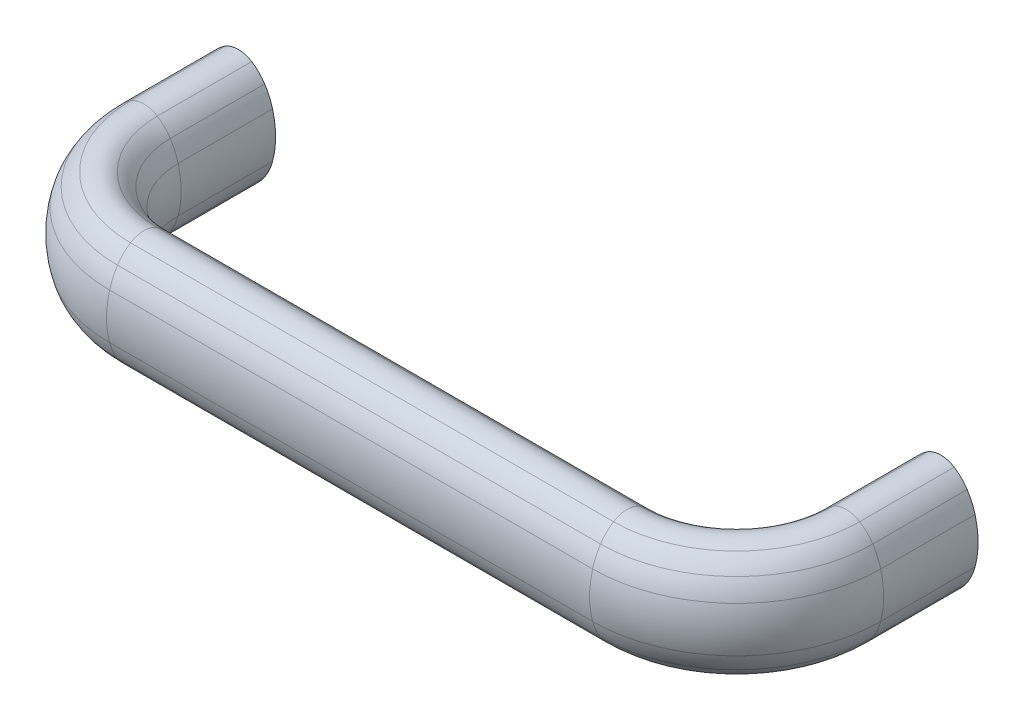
ISO-10303-21;
HEADER;
FILE_DESCRIPTION(('STEP AP214'),'2;1');
FILE_NAME('part.step','',(''),(''),'','','');
FILE_SCHEMA(('AUTOMOTIVE_DESIGN { 1 0 10303 214 1 1 1 1 }'));
ENDSEC;
DATA;
#1=APPLICATION_CONTEXT('core data for automotive mechanical design processes');
#2=APPLICATION_PROTOCOL_DEFINITION('international standard','automotive_design',2000,#1);
#3=PRODUCT_CONTEXT('',#1,'mechanical');
#4=PRODUCT('Part','Part','',(#3));
#5=PRODUCT_RELATED_PRODUCT_CATEGORY('part','',(#4));
#6=PRODUCT_DEFINITION_FORMATION('','',#4);
#7=PRODUCT_DEFINITION_CONTEXT('part definition',#1,'design');
#8=PRODUCT_DEFINITION('design','',#6,#7);
#9=PRODUCT_DEFINITION_SHAPE('','',#8);
#10=(LENGTH_UNIT() NAMED_UNIT(*) SI_UNIT(.MILLI.,.METRE.));
#11=(NAMED_UNIT(*) PLANE_ANGLE_UNIT() SI_UNIT($,.RADIAN.));
#12=(NAMED_UNIT(*) SI_UNIT($,.STERADIAN.) SOLID_ANGLE_UNIT());
#13=UNCERTAINTY_MEASURE_WITH_UNIT(LENGTH_MEASURE(1.E-05),#10,'distance_accuracy_value','');
#14=(GEOMETRIC_REPRESENTATION_CONTEXT(3) GLOBAL_UNCERTAINTY_ASSIGNED_CONTEXT((#13)) GLOBAL_UNIT_ASSIGNED_CONTEXT((#10,
#11,#12)) REPRESENTATION_CONTEXT('',''));
#15=CARTESIAN_POINT('',(0.,0.,0.));
#16=DIRECTION('',(0.,0.,1.));
#17=DIRECTION('',(1.,0.,0.));
#18=AXIS2_PLACEMENT_3D('',#15,#16,#17);
#19=CARTESIAN_POINT('',(161.10831860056,-5.5628443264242,0.));
#20=DIRECTION('',(0.,0.,-1.));
#21=DIRECTION('',(0.,-1.,0.));
#22=AXIS2_PLACEMENT_3D('',#19,#20,#21);
#23=PLANE('',#22);
#24=CARTESIAN_POINT('',(159.999387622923,-7.31331876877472,0.));
#25=DIRECTION('',(0.,0.,-1.));
#26=DIRECTION('',(0.,-1.,0.));
#27=AXIS2_PLACEMENT_3D('',#24,#25,#26);
#28=CIRCLE('',#27,5.68668538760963);
#29=CARTESIAN_POINT('',(163.042642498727,-12.1171703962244,0.));
#30=VERTEX_POINT('',#29);
#31=CARTESIAN_POINT('',(156.95613274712,-12.1171703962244,0.));
#32=VERTEX_POINT('',#31);
#33=EDGE_CURVE('E540',#30,#32,#28,.T.);
#34=ORIENTED_EDGE('',*,*,#33,.T.);
#35=CARTESIAN_POINT('',(162.217249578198,-3.81236988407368,0.));
#36=DIRECTION('',(0.,0.,-1.));
#37=DIRECTION('',(0.,-1.,0.));
#38=AXIS2_PLACEMENT_3D('',#35,#36,#37);
#39=CIRCLE('',#38,9.83102547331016);
#40=CARTESIAN_POINT('',(153.988979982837,-9.19239231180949,0.));
#41=VERTEX_POINT('',#40);
#42=EDGE_CURVE('E18',#32,#41,#39,.T.);
#43=ORIENTED_EDGE('',*,*,#42,.T.);
#44=CARTESIAN_POINT('',(165.739270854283,-1.50950981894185,0.));
#45=DIRECTION('',(0.,0.,-1.));
#46=DIRECTION('',(0.,-1.,0.));
#47=AXIS2_PLACEMENT_3D('',#44,#45,#46);
#48=CIRCLE('',#47,14.0390889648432);
#49=CARTESIAN_POINT('',(152.188367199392,-5.17952740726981,0.));
#50=VERTEX_POINT('',#49);
#51=EDGE_CURVE('E38',#41,#50,#48,.T.);
#52=ORIENTED_EDGE('',*,*,#51,.T.);
#53=CARTESIAN_POINT('',(171.312858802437,-4.15638432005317E-06,0.));
#54=DIRECTION('',(0.,0.,-1.));
#55=DIRECTION('',(0.,-1.,0.));
#56=AXIS2_PLACEMENT_3D('',#53,#54,#55);
#57=CIRCLE('',#56,19.8134711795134);
#58=CARTESIAN_POINT('',(152.188367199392,5.17951909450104,0.));
#59=VERTEX_POINT('',#58);
#60=EDGE_CURVE('E623',#50,#59,#57,.T.);
#61=ORIENTED_EDGE('',*,*,#60,.T.);
#62=CARTESIAN_POINT('',(165.739270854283,1.50950150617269,0.));
#63=DIRECTION('',(0.,0.,-1.));
#64=DIRECTION('',(0.,-1.,0.));
#65=AXIS2_PLACEMENT_3D('',#62,#63,#64);
#66=CIRCLE('',#65,14.0390889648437);
#67=CARTESIAN_POINT('',(153.988979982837,9.19238399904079,0.));
#68=VERTEX_POINT('',#67);
#69=EDGE_CURVE('E620',#59,#68,#66,.T.);
#70=ORIENTED_EDGE('',*,*,#69,.T.);
#71=CARTESIAN_POINT('',(162.217249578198,3.81236157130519,0.));
#72=DIRECTION('',(0.,0.,-1.));
#73=DIRECTION('',(0.,-1.,0.));
#74=AXIS2_PLACEMENT_3D('',#71,#72,#73);
#75=CIRCLE('',#74,9.83102547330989);
#76=CARTESIAN_POINT('',(156.95613274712,12.1171620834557,0.));
#77=VERTEX_POINT('',#76);
#78=EDGE_CURVE('E617',#68,#77,#75,.T.);
#79=ORIENTED_EDGE('',*,*,#78,.T.);
#80=CARTESIAN_POINT('',(159.999387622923,7.31331045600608,0.));
#81=DIRECTION('',(0.,0.,1.));
#82=DIRECTION('',(0.,1.,0.));
#83=AXIS2_PLACEMENT_3D('',#80,#81,#82);
#84=CIRCLE('',#83,5.68668538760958);
#85=CARTESIAN_POINT('',(163.042642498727,12.1171620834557,0.));
#86=VERTEX_POINT('',#85);
#87=EDGE_CURVE('E615',#86,#77,#84,.T.);
#88=ORIENTED_EDGE('',*,*,#87,.F.);
#89=CARTESIAN_POINT('',(157.781525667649,3.81236157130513,0.));
#90=DIRECTION('',(0.,0.,1.));
#91=DIRECTION('',(0.,1.,0.));
#92=AXIS2_PLACEMENT_3D('',#89,#90,#91);
#93=CIRCLE('',#92,9.83102547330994);
#94=CARTESIAN_POINT('',(166.009795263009,9.19238399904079,0.));
#95=VERTEX_POINT('',#94);
#96=EDGE_CURVE('E613',#95,#86,#93,.T.);
#97=ORIENTED_EDGE('',*,*,#96,.F.);
#98=CARTESIAN_POINT('',(154.259504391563,1.50950150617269,0.));
#99=DIRECTION('',(0.,0.,1.));
#100=DIRECTION('',(0.,1.,0.));
#101=AXIS2_PLACEMENT_3D('',#98,#99,#100);
#102=CIRCLE('',#101,14.0390889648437);
#103=CARTESIAN_POINT('',(167.810408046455,5.17951909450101,0.));
#104=VERTEX_POINT('',#103);
#105=EDGE_CURVE('E611',#104,#95,#102,.T.);
#106=ORIENTED_EDGE('',*,*,#105,.F.);
#107=CARTESIAN_POINT('',(148.68591644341,-4.1563845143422E-06,0.));
#108=DIRECTION('',(0.,0.,1.));
#109=DIRECTION('',(0.,1.,0.));
#110=AXIS2_PLACEMENT_3D('',#107,#108,#109);
#111=CIRCLE('',#110,19.8134711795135);
#112=CARTESIAN_POINT('',(167.810408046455,-5.17952740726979,0.));
#113=VERTEX_POINT('',#112);
#114=EDGE_CURVE('E609',#113,#104,#111,.T.);
#115=ORIENTED_EDGE('',*,*,#114,.F.);
#116=CARTESIAN_POINT('',(154.259504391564,-1.50950981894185,0.));
#117=DIRECTION('',(0.,0.,1.));
#118=DIRECTION('',(0.,1.,0.));
#119=AXIS2_PLACEMENT_3D('',#116,#117,#118);
#120=CIRCLE('',#119,14.0390889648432);
#121=CARTESIAN_POINT('',(166.009795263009,-9.19239231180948,0.));
#122=VERTEX_POINT('',#121);
#123=EDGE_CURVE('E607',#122,#113,#120,.T.);
#124=ORIENTED_EDGE('',*,*,#123,.F.);
#125=CARTESIAN_POINT('',(157.781525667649,-3.81236988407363,0.));
#126=DIRECTION('',(0.,0.,1.));
#127=DIRECTION('',(0.,1.,0.));
#128=AXIS2_PLACEMENT_3D('',#125,#126,#127);
#129=CIRCLE('',#128,9.83102547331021);
#130=EDGE_CURVE('E605',#30,#122,#129,.T.);
#131=ORIENTED_EDGE('',*,*,#130,.F.);
#132=EDGE_LOOP('',(#34,#43,#52,#61,#70,#79,#88,#97,#106,#115,#124,#131));
#133=FACE_BOUND('',#132,.T.);
#134=CARTESIAN_POINT('',(160.,0.,0.));
#135=DIRECTION('',(0.,0.,1.));
#136=DIRECTION('',(0.,1.,0.));
#137=AXIS2_PLACEMENT_3D('',#134,#135,#136);
#138=CIRCLE('',#137,4.52350000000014);
#139=CARTESIAN_POINT('',(160.,4.52350000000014,0.));
#140=VERTEX_POINT('',#139);
#141=EDGE_CURVE('E1387',#140,#140,#138,.T.);
#142=ORIENTED_EDGE('',*,*,#141,.T.);
#143=EDGE_LOOP('',(#142));
#144=FACE_BOUND('',#143,.T.);
#145=ADVANCED_FACE('F14',(#133,#144),#23,.T.);
#146=CARTESIAN_POINT('',(-1.10831860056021,-5.5628443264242,0.));
#147=DIRECTION('',(0.,0.,1.));
#148=DIRECTION('',(0.,-1.,0.));
#149=AXIS2_PLACEMENT_3D('',#146,#147,#148);
#150=PLANE('',#149);
#151=CARTESIAN_POINT('',(0.000612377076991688,-7.31331876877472,0.));
#152=DIRECTION('',(0.,0.,1.));
#153=DIRECTION('',(0.,-1.,0.));
#154=AXIS2_PLACEMENT_3D('',#151,#152,#153);
#155=CIRCLE('',#154,5.68668538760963);
#156=CARTESIAN_POINT('',(-3.04264249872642,-12.1171703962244,0.));
#157=VERTEX_POINT('',#156);
#158=CARTESIAN_POINT('',(3.04386725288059,-12.1171703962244,0.));
#159=VERTEX_POINT('',#158);
#160=EDGE_CURVE('E264',#157,#159,#155,.T.);
#161=ORIENTED_EDGE('',*,*,#160,.F.);
#162=CARTESIAN_POINT('',(2.21847433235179,-3.81236988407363,0.));
#163=DIRECTION('',(0.,0.,-1.));
#164=DIRECTION('',(0.,1.,0.));
#165=AXIS2_PLACEMENT_3D('',#162,#163,#164);
#166=CIRCLE('',#165,9.83102547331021);
#167=CARTESIAN_POINT('',(-6.00979526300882,-9.19239231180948,0.));
#168=VERTEX_POINT('',#167);
#169=EDGE_CURVE('E305',#157,#168,#166,.T.);
#170=ORIENTED_EDGE('',*,*,#169,.T.);
#171=CARTESIAN_POINT('',(5.74049560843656,-1.50950981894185,0.));
#172=DIRECTION('',(0.,0.,-1.));
#173=DIRECTION('',(0.,1.,0.));
#174=AXIS2_PLACEMENT_3D('',#171,#172,#173);
#175=CIRCLE('',#174,14.0390889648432);
#176=CARTESIAN_POINT('',(-7.81040804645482,-5.17952740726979,0.));
#177=VERTEX_POINT('',#176);
#178=EDGE_CURVE('E302',#168,#177,#175,.T.);
#179=ORIENTED_EDGE('',*,*,#178,.T.);
#180=CARTESIAN_POINT('',(11.3140835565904,-4.1563845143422E-06,0.));
#181=DIRECTION('',(0.,0.,-1.));
#182=DIRECTION('',(0.,1.,0.));
#183=AXIS2_PLACEMENT_3D('',#180,#181,#182);
#184=CIRCLE('',#183,19.8134711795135);
#185=CARTESIAN_POINT('',(-7.81040804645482,5.17951909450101,0.));
#186=VERTEX_POINT('',#185);
#187=EDGE_CURVE('E299',#177,#186,#184,.T.);
#188=ORIENTED_EDGE('',*,*,#187,.T.);
#189=CARTESIAN_POINT('',(5.74049560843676,1.50950150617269,0.));
#190=DIRECTION('',(0.,0.,-1.));
#191=DIRECTION('',(0.,1.,0.));
#192=AXIS2_PLACEMENT_3D('',#189,#190,#191);
#193=CIRCLE('',#192,14.0390889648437);
#194=CARTESIAN_POINT('',(-6.00979526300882,9.19238399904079,0.));
#195=VERTEX_POINT('',#194);
#196=EDGE_CURVE('E296',#186,#195,#193,.T.);
#197=ORIENTED_EDGE('',*,*,#196,.T.);
#198=CARTESIAN_POINT('',(2.21847433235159,3.81236157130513,0.));
#199=DIRECTION('',(0.,0.,-1.));
#200=DIRECTION('',(0.,1.,0.));
#201=AXIS2_PLACEMENT_3D('',#198,#199,#200);
#202=CIRCLE('',#201,9.83102547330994);
#203=CARTESIAN_POINT('',(-3.04264249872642,12.1171620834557,0.));
#204=VERTEX_POINT('',#203);
#205=EDGE_CURVE('E293',#195,#204,#202,.T.);
#206=ORIENTED_EDGE('',*,*,#205,.T.);
#207=CARTESIAN_POINT('',(0.000612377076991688,7.31331045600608,0.));
#208=DIRECTION('',(0.,0.,1.));
#209=DIRECTION('',(0.,-1.,0.));
#210=AXIS2_PLACEMENT_3D('',#207,#208,#209);
#211=CIRCLE('',#210,5.68668538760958);
#212=CARTESIAN_POINT('',(3.04386725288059,12.1171620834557,0.));
#213=VERTEX_POINT('',#212);
#214=EDGE_CURVE('E291',#213,#204,#211,.T.);
#215=ORIENTED_EDGE('',*,*,#214,.F.);
#216=CARTESIAN_POINT('',(-2.21724957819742,3.81236157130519,0.));
#217=DIRECTION('',(0.,0.,1.));
#218=DIRECTION('',(0.,-1.,0.));
#219=AXIS2_PLACEMENT_3D('',#216,#217,#218);
#220=CIRCLE('',#219,9.83102547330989);
#221=CARTESIAN_POINT('',(6.01102001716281,9.19238399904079,0.));
#222=VERTEX_POINT('',#221);
#223=EDGE_CURVE('E288',#222,#213,#220,.T.);
#224=ORIENTED_EDGE('',*,*,#223,.F.);
#225=CARTESIAN_POINT('',(-5.73927085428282,1.50950150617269,0.));
#226=DIRECTION('',(0.,0.,1.));
#227=DIRECTION('',(0.,-1.,0.));
#228=AXIS2_PLACEMENT_3D('',#225,#226,#227);
#229=CIRCLE('',#228,14.0390889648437);
#230=CARTESIAN_POINT('',(7.81163280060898,5.17951909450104,0.));
#231=VERTEX_POINT('',#230);
#232=EDGE_CURVE('E285',#231,#222,#229,.T.);
#233=ORIENTED_EDGE('',*,*,#232,.F.);
#234=CARTESIAN_POINT('',(-11.3128588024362,-4.15638432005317E-06,0.));
#235=DIRECTION('',(0.,0.,1.));
#236=DIRECTION('',(0.,-1.,0.));
#237=AXIS2_PLACEMENT_3D('',#234,#235,#236);
#238=CIRCLE('',#237,19.8134711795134);
#239=CARTESIAN_POINT('',(7.81163280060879,-5.17952740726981,0.));
#240=VERTEX_POINT('',#239);
#241=EDGE_CURVE('E279',#240,#231,#238,.T.);
#242=ORIENTED_EDGE('',*,*,#241,.F.);
#243=CARTESIAN_POINT('',(-5.73927085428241,-1.50950981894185,0.));
#244=DIRECTION('',(0.,0.,1.));
#245=DIRECTION('',(0.,-1.,0.));
#246=AXIS2_PLACEMENT_3D('',#243,#244,#245);
#247=CIRCLE('',#246,14.0390889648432);
#248=CARTESIAN_POINT('',(6.01102001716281,-9.19239231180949,0.));
#249=VERTEX_POINT('',#248);
#250=EDGE_CURVE('E277',#249,#240,#247,.T.);
#251=ORIENTED_EDGE('',*,*,#250,.F.);
#252=CARTESIAN_POINT('',(-2.21724957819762,-3.81236988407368,0.));
#253=DIRECTION('',(0.,0.,1.));
#254=DIRECTION('',(0.,-1.,0.));
#255=AXIS2_PLACEMENT_3D('',#252,#253,#254);
#256=CIRCLE('',#255,9.83102547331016);
#257=EDGE_CURVE('E255',#159,#249,#256,.T.);
#258=ORIENTED_EDGE('',*,*,#257,.F.);
#259=EDGE_LOOP('',(#161,#170,#179,#188,#197,#206,#215,#224,#233,#242,#251,#258));
#260=FACE_BOUND('',#259,.T.);
#261=CARTESIAN_POINT('',(0.,0.,0.));
#262=DIRECTION('',(0.,0.,-1.));
#263=DIRECTION('',(0.,1.,0.));
#264=AXIS2_PLACEMENT_3D('',#261,#262,#263);
#265=CIRCLE('',#264,4.52350000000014);
#266=CARTESIAN_POINT('',(0.,4.52350000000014,0.));
#267=VERTEX_POINT('',#266);
#268=EDGE_CURVE('E271',#267,#267,#265,.T.);
#269=ORIENTED_EDGE('',*,*,#268,.F.);
#270=EDGE_LOOP('',(#269));
#271=FACE_BOUND('',#270,.T.);
#272=ADVANCED_FACE('F273',(#260,#271),#150,.F.);
#273=CARTESIAN_POINT('',(162.217249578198,-3.81236988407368,21.5));
#274=DIRECTION('',(0.,0.,-1.));
#275=DIRECTION('',(0.,1.,0.));
#276=AXIS2_PLACEMENT_3D('',#273,#274,#275);
#277=CYLINDRICAL_SURFACE('',#276,9.83102547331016);
#278=CARTESIAN_POINT('',(162.217249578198,-3.81236988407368,21.5));
#279=DIRECTION('',(0.,0.,-1.));
#280=DIRECTION('',(0.,-1.,0.));
#281=AXIS2_PLACEMENT_3D('',#278,#279,#280);
#282=CIRCLE('',#281,9.83102547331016);
#283=CARTESIAN_POINT('',(156.95613274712,-12.1171703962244,21.5));
#284=VERTEX_POINT('',#283);
#285=CARTESIAN_POINT('',(153.988979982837,-9.19239231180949,21.5));
#286=VERTEX_POINT('',#285);
#287=EDGE_CURVE('E507',#284,#286,#282,.T.);
#288=ORIENTED_EDGE('',*,*,#287,.T.);
#289=DIRECTION('',(0.,0.,-1.));
#290=VECTOR('',#289,1.);
#291=CARTESIAN_POINT('',(153.988979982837,-9.19239231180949,21.5));
#292=LINE('',#291,#290);
#293=EDGE_CURVE('E23',#286,#41,#292,.T.);
#294=ORIENTED_EDGE('',*,*,#293,.T.);
#295=ORIENTED_EDGE('',*,*,#42,.F.);
#296=DIRECTION('',(0.,0.,-1.));
#297=VECTOR('',#296,1.);
#298=CARTESIAN_POINT('',(156.95613274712,-12.1171703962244,21.5));
#299=LINE('',#298,#297);
#300=EDGE_CURVE('E9',#284,#32,#299,.T.);
#301=ORIENTED_EDGE('',*,*,#300,.F.);
#302=EDGE_LOOP('',(#288,#294,#295,#301));
#303=FACE_BOUND('',#302,.T.);
#304=ADVANCED_FACE('F16',(#303),#277,.T.);
#305=CARTESIAN_POINT('',(165.739270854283,-1.50950981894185,21.5));
#306=DIRECTION('',(0.,0.,-1.));
#307=DIRECTION('',(0.,1.,0.));
#308=AXIS2_PLACEMENT_3D('',#305,#306,#307);
#309=CYLINDRICAL_SURFACE('',#308,14.0390889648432);
#310=CARTESIAN_POINT('',(165.739270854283,-1.50950981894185,21.5));
#311=DIRECTION('',(0.,0.,-1.));
#312=DIRECTION('',(0.,-1.,0.));
#313=AXIS2_PLACEMENT_3D('',#310,#311,#312);
#314=CIRCLE('',#313,14.0390889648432);
#315=CARTESIAN_POINT('',(152.188367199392,-5.17952740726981,21.5));
#316=VERTEX_POINT('',#315);
#317=EDGE_CURVE('E569',#286,#316,#314,.T.);
#318=ORIENTED_EDGE('',*,*,#317,.T.);
#319=DIRECTION('',(0.,0.,-1.));
#320=VECTOR('',#319,1.);
#321=CARTESIAN_POINT('',(152.188367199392,-5.17952740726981,21.5));
#322=LINE('',#321,#320);
#323=EDGE_CURVE('E601',#316,#50,#322,.T.);
#324=ORIENTED_EDGE('',*,*,#323,.T.);
#325=ORIENTED_EDGE('',*,*,#51,.F.);
#326=ORIENTED_EDGE('',*,*,#293,.F.);
#327=EDGE_LOOP('',(#318,#324,#325,#326));
#328=FACE_BOUND('',#327,.T.);
#329=ADVANCED_FACE('F630',(#328),#309,.T.);
#330=CARTESIAN_POINT('',(171.312858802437,-4.15638432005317E-06,21.5));
#331=DIRECTION('',(0.,0.,-1.));
#332=DIRECTION('',(0.,1.,0.));
#333=AXIS2_PLACEMENT_3D('',#330,#331,#332);
#334=CYLINDRICAL_SURFACE('',#333,19.8134711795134);
#335=CARTESIAN_POINT('',(171.312858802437,-4.15638432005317E-06,21.5));
#336=DIRECTION('',(0.,0.,-1.));
#337=DIRECTION('',(0.,-1.,0.));
#338=AXIS2_PLACEMENT_3D('',#335,#336,#337);
#339=CIRCLE('',#338,19.8134711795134);
#340=CARTESIAN_POINT('',(152.188367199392,5.17951909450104,21.5));
#341=VERTEX_POINT('',#340);
#342=EDGE_CURVE('E566',#316,#341,#339,.T.);
#343=ORIENTED_EDGE('',*,*,#342,.T.);
#344=DIRECTION('',(0.,0.,-1.));
#345=VECTOR('',#344,1.);
#346=CARTESIAN_POINT('',(152.188367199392,5.17951909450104,21.5));
#347=LINE('',#346,#345);
#348=EDGE_CURVE('E598',#341,#59,#347,.T.);
#349=ORIENTED_EDGE('',*,*,#348,.T.);
#350=ORIENTED_EDGE('',*,*,#60,.F.);
#351=ORIENTED_EDGE('',*,*,#323,.F.);
#352=EDGE_LOOP('',(#343,#349,#350,#351));
#353=FACE_BOUND('',#352,.T.);
#354=ADVANCED_FACE('F685',(#353),#334,.T.);
#355=CARTESIAN_POINT('',(165.739270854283,1.50950150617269,21.5));
#356=DIRECTION('',(0.,0.,-1.));
#357=DIRECTION('',(0.,1.,0.));
#358=AXIS2_PLACEMENT_3D('',#355,#356,#357);
#359=CYLINDRICAL_SURFACE('',#358,14.0390889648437);
#360=CARTESIAN_POINT('',(165.739270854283,1.50950150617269,21.5));
#361=DIRECTION('',(0.,0.,-1.));
#362=DIRECTION('',(0.,-1.,0.));
#363=AXIS2_PLACEMENT_3D('',#360,#361,#362);
#364=CIRCLE('',#363,14.0390889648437);
#365=CARTESIAN_POINT('',(153.988979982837,9.19238399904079,21.5));
#366=VERTEX_POINT('',#365);
#367=EDGE_CURVE('E563',#341,#366,#364,.T.);
#368=ORIENTED_EDGE('',*,*,#367,.T.);
#369=DIRECTION('',(0.,0.,-1.));
#370=VECTOR('',#369,1.);
#371=CARTESIAN_POINT('',(153.988979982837,9.19238399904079,21.5));
#372=LINE('',#371,#370);
#373=EDGE_CURVE('E595',#366,#68,#372,.T.);
#374=ORIENTED_EDGE('',*,*,#373,.T.);
#375=ORIENTED_EDGE('',*,*,#69,.F.);
#376=ORIENTED_EDGE('',*,*,#348,.F.);
#377=EDGE_LOOP('',(#368,#374,#375,#376));
#378=FACE_BOUND('',#377,.T.);
#379=ADVANCED_FACE('F684',(#378),#359,.T.);
#380=CARTESIAN_POINT('',(162.217249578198,3.81236157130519,21.5));
#381=DIRECTION('',(0.,0.,-1.));
#382=DIRECTION('',(0.,1.,0.));
#383=AXIS2_PLACEMENT_3D('',#380,#381,#382);
#384=CYLINDRICAL_SURFACE('',#383,9.83102547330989);
#385=CARTESIAN_POINT('',(162.217249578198,3.81236157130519,21.5));
#386=DIRECTION('',(0.,0.,-1.));
#387=DIRECTION('',(0.,-1.,0.));
#388=AXIS2_PLACEMENT_3D('',#385,#386,#387);
#389=CIRCLE('',#388,9.83102547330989);
#390=CARTESIAN_POINT('',(156.95613274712,12.1171620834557,21.5));
#391=VERTEX_POINT('',#390);
#392=EDGE_CURVE('E560',#366,#391,#389,.T.);
#393=ORIENTED_EDGE('',*,*,#392,.T.);
#394=DIRECTION('',(0.,0.,-1.));
#395=VECTOR('',#394,1.);
#396=CARTESIAN_POINT('',(156.95613274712,12.1171620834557,21.5));
#397=LINE('',#396,#395);
#398=EDGE_CURVE('E592',#391,#77,#397,.T.);
#399=ORIENTED_EDGE('',*,*,#398,.T.);
#400=ORIENTED_EDGE('',*,*,#78,.F.);
#401=ORIENTED_EDGE('',*,*,#373,.F.);
#402=EDGE_LOOP('',(#393,#399,#400,#401));
#403=FACE_BOUND('',#402,.T.);
#404=ADVANCED_FACE('F690',(#403),#384,.T.);
#405=CARTESIAN_POINT('',(159.999387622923,7.31331045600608,21.5));
#406=DIRECTION('',(0.,0.,-1.));
#407=DIRECTION('',(0.,1.,0.));
#408=AXIS2_PLACEMENT_3D('',#405,#406,#407);
#409=CYLINDRICAL_SURFACE('',#408,5.68668538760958);
#410=CARTESIAN_POINT('',(159.999387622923,7.31331045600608,21.5));
#411=DIRECTION('',(0.,0.,1.));
#412=DIRECTION('',(0.,1.,0.));
#413=AXIS2_PLACEMENT_3D('',#410,#411,#412);
#414=CIRCLE('',#413,5.68668538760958);
#415=CARTESIAN_POINT('',(163.042642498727,12.1171620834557,21.5));
#416=VERTEX_POINT('',#415);
#417=EDGE_CURVE('E558',#416,#391,#414,.T.);
#418=ORIENTED_EDGE('',*,*,#417,.F.);
#419=DIRECTION('',(0.,0.,-1.));
#420=VECTOR('',#419,1.);
#421=CARTESIAN_POINT('',(163.042642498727,12.1171620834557,21.5));
#422=LINE('',#421,#420);
#423=EDGE_CURVE('E589',#416,#86,#422,.T.);
#424=ORIENTED_EDGE('',*,*,#423,.T.);
#425=ORIENTED_EDGE('',*,*,#87,.T.);
#426=ORIENTED_EDGE('',*,*,#398,.F.);
#427=EDGE_LOOP('',(#418,#424,#425,#426));
#428=FACE_BOUND('',#427,.T.);
#429=ADVANCED_FACE('F693',(#428),#409,.T.);
#430=CARTESIAN_POINT('',(157.781525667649,3.81236157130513,21.5));
#431=DIRECTION('',(0.,0.,-1.));
#432=DIRECTION('',(0.,1.,0.));
#433=AXIS2_PLACEMENT_3D('',#430,#431,#432);
#434=CYLINDRICAL_SURFACE('',#433,9.83102547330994);
#435=CARTESIAN_POINT('',(157.781525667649,3.81236157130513,21.5));
#436=DIRECTION('',(0.,0.,1.));
#437=DIRECTION('',(0.,1.,0.));
#438=AXIS2_PLACEMENT_3D('',#435,#436,#437);
#439=CIRCLE('',#438,9.83102547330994);
#440=CARTESIAN_POINT('',(166.009795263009,9.19238399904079,21.5));
#441=VERTEX_POINT('',#440);
#442=EDGE_CURVE('E555',#441,#416,#439,.T.);
#443=ORIENTED_EDGE('',*,*,#442,.F.);
#444=DIRECTION('',(0.,0.,-1.));
#445=VECTOR('',#444,1.);
#446=CARTESIAN_POINT('',(166.009795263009,9.19238399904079,21.5));
#447=LINE('',#446,#445);
#448=EDGE_CURVE('E586',#441,#95,#447,.T.);
#449=ORIENTED_EDGE('',*,*,#448,.T.);
#450=ORIENTED_EDGE('',*,*,#96,.T.);
#451=ORIENTED_EDGE('',*,*,#423,.F.);
#452=EDGE_LOOP('',(#443,#449,#450,#451));
#453=FACE_BOUND('',#452,.T.);
#454=ADVANCED_FACE('F696',(#453),#434,.T.);
#455=CARTESIAN_POINT('',(154.259504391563,1.50950150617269,21.5));
#456=DIRECTION('',(0.,0.,-1.));
#457=DIRECTION('',(0.,1.,0.));
#458=AXIS2_PLACEMENT_3D('',#455,#456,#457);
#459=CYLINDRICAL_SURFACE('',#458,14.0390889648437);
#460=CARTESIAN_POINT('',(154.259504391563,1.50950150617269,21.5));
#461=DIRECTION('',(0.,0.,1.));
#462=DIRECTION('',(0.,1.,0.));
#463=AXIS2_PLACEMENT_3D('',#460,#461,#462);
#464=CIRCLE('',#463,14.0390889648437);
#465=CARTESIAN_POINT('',(167.810408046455,5.17951909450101,21.5));
#466=VERTEX_POINT('',#465);
#467=EDGE_CURVE('E552',#466,#441,#464,.T.);
#468=ORIENTED_EDGE('',*,*,#467,.F.);
#469=DIRECTION('',(0.,0.,-1.));
#470=VECTOR('',#469,1.);
#471=CARTESIAN_POINT('',(167.810408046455,5.17951909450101,21.5));
#472=LINE('',#471,#470);
#473=EDGE_CURVE('E583',#466,#104,#472,.T.);
#474=ORIENTED_EDGE('',*,*,#473,.T.);
#475=ORIENTED_EDGE('',*,*,#105,.T.);
#476=ORIENTED_EDGE('',*,*,#448,.F.);
#477=EDGE_LOOP('',(#468,#474,#475,#476));
#478=FACE_BOUND('',#477,.T.);
#479=ADVANCED_FACE('F702',(#478),#459,.T.);
#480=CARTESIAN_POINT('',(148.68591644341,-4.1563845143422E-06,21.5));
#481=DIRECTION('',(0.,0.,-1.));
#482=DIRECTION('',(0.,1.,0.));
#483=AXIS2_PLACEMENT_3D('',#480,#481,#482);
#484=CYLINDRICAL_SURFACE('',#483,19.8134711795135);
#485=CARTESIAN_POINT('',(148.68591644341,-4.1563845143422E-06,21.5));
#486=DIRECTION('',(0.,0.,1.));
#487=DIRECTION('',(0.,1.,0.));
#488=AXIS2_PLACEMENT_3D('',#485,#486,#487);
#489=CIRCLE('',#488,19.8134711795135);
#490=CARTESIAN_POINT('',(167.810408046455,-5.17952740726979,21.5));
#491=VERTEX_POINT('',#490);
#492=EDGE_CURVE('E549',#491,#466,#489,.T.);
#493=ORIENTED_EDGE('',*,*,#492,.F.);
#494=DIRECTION('',(0.,0.,-1.));
#495=VECTOR('',#494,1.);
#496=CARTESIAN_POINT('',(167.810408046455,-5.17952740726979,21.5));
#497=LINE('',#496,#495);
#498=EDGE_CURVE('E580',#491,#113,#497,.T.);
#499=ORIENTED_EDGE('',*,*,#498,.T.);
#500=ORIENTED_EDGE('',*,*,#114,.T.);
#501=ORIENTED_EDGE('',*,*,#473,.F.);
#502=EDGE_LOOP('',(#493,#499,#500,#501));
#503=FACE_BOUND('',#502,.T.);
#504=ADVANCED_FACE('F705',(#503),#484,.T.);
#505=CARTESIAN_POINT('',(154.259504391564,-1.50950981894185,21.5));
#506=DIRECTION('',(0.,0.,-1.));
#507=DIRECTION('',(0.,1.,0.));
#508=AXIS2_PLACEMENT_3D('',#505,#506,#507);
#509=CYLINDRICAL_SURFACE('',#508,14.0390889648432);
#510=CARTESIAN_POINT('',(154.259504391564,-1.50950981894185,21.5));
#511=DIRECTION('',(0.,0.,1.));
#512=DIRECTION('',(0.,1.,0.));
#513=AXIS2_PLACEMENT_3D('',#510,#511,#512);
#514=CIRCLE('',#513,14.0390889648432);
#515=CARTESIAN_POINT('',(166.009795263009,-9.19239231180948,21.5));
#516=VERTEX_POINT('',#515);
#517=EDGE_CURVE('E546',#516,#491,#514,.T.);
#518=ORIENTED_EDGE('',*,*,#517,.F.);
#519=DIRECTION('',(0.,0.,-1.));
#520=VECTOR('',#519,1.);
#521=CARTESIAN_POINT('',(166.009795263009,-9.19239231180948,21.5));
#522=LINE('',#521,#520);
#523=EDGE_CURVE('E577',#516,#122,#522,.T.);
#524=ORIENTED_EDGE('',*,*,#523,.T.);
#525=ORIENTED_EDGE('',*,*,#123,.T.);
#526=ORIENTED_EDGE('',*,*,#498,.F.);
#527=EDGE_LOOP('',(#518,#524,#525,#526));
#528=FACE_BOUND('',#527,.T.);
#529=ADVANCED_FACE('F708',(#528),#509,.T.);
#530=CARTESIAN_POINT('',(157.781525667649,-3.81236988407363,21.5));
#531=DIRECTION('',(0.,0.,-1.));
#532=DIRECTION('',(0.,1.,0.));
#533=AXIS2_PLACEMENT_3D('',#530,#531,#532);
#534=CYLINDRICAL_SURFACE('',#533,9.83102547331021);
#535=CARTESIAN_POINT('',(157.781525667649,-3.81236988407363,21.5));
#536=DIRECTION('',(0.,0.,1.));
#537=DIRECTION('',(0.,1.,0.));
#538=AXIS2_PLACEMENT_3D('',#535,#536,#537);
#539=CIRCLE('',#538,9.83102547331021);
#540=CARTESIAN_POINT('',(163.042642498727,-12.1171703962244,21.5));
#541=VERTEX_POINT('',#540);
#542=EDGE_CURVE('E543',#541,#516,#539,.T.);
#543=ORIENTED_EDGE('',*,*,#542,.F.);
#544=DIRECTION('',(0.,0.,-1.));
#545=VECTOR('',#544,1.);
#546=CARTESIAN_POINT('',(163.042642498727,-12.1171703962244,21.5));
#547=LINE('',#546,#545);
#548=EDGE_CURVE('E574',#541,#30,#547,.T.);
#549=ORIENTED_EDGE('',*,*,#548,.T.);
#550=ORIENTED_EDGE('',*,*,#130,.T.);
#551=ORIENTED_EDGE('',*,*,#523,.F.);
#552=EDGE_LOOP('',(#543,#549,#550,#551));
#553=FACE_BOUND('',#552,.T.);
#554=ADVANCED_FACE('F712',(#553),#534,.T.);
#555=CARTESIAN_POINT('',(159.999387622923,-7.31331876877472,21.5));
#556=DIRECTION('',(0.,0.,-1.));
#557=DIRECTION('',(0.,1.,0.));
#558=AXIS2_PLACEMENT_3D('',#555,#556,#557);
#559=CYLINDRICAL_SURFACE('',#558,5.68668538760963);
#560=CARTESIAN_POINT('',(159.999387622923,-7.31331876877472,21.5));
#561=DIRECTION('',(0.,0.,-1.));
#562=DIRECTION('',(0.,-1.,0.));
#563=AXIS2_PLACEMENT_3D('',#560,#561,#562);
#564=CIRCLE('',#563,5.68668538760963);
#565=EDGE_CURVE('E469',#541,#284,#564,.T.);
#566=ORIENTED_EDGE('',*,*,#565,.T.);
#567=ORIENTED_EDGE('',*,*,#300,.T.);
#568=ORIENTED_EDGE('',*,*,#33,.F.);
#569=ORIENTED_EDGE('',*,*,#548,.F.);
#570=EDGE_LOOP('',(#566,#567,#568,#569));
#571=FACE_BOUND('',#570,.T.);
#572=ADVANCED_FACE('F714',(#571),#559,.T.);
#573=CARTESIAN_POINT('',(135.,-3.81236988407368,21.5));
#574=DIRECTION('',(0.,1.,0.));
#575=DIRECTION('',(-1.,0.,0.));
#576=AXIS2_PLACEMENT_3D('',#573,#574,#575);
#577=TOROIDAL_SURFACE('',#576,27.2172495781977,9.83102547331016);
#578=CARTESIAN_POINT('',(135.,-3.81236988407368,48.7172495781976));
#579=DIRECTION('',(1.,0.,0.));
#580=DIRECTION('',(0.,-1.,0.));
#581=AXIS2_PLACEMENT_3D('',#578,#579,#580);
#582=CIRCLE('',#581,9.83102547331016);
#583=CARTESIAN_POINT('',(135.,-12.1171703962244,43.4561327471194));
#584=VERTEX_POINT('',#583);
#585=CARTESIAN_POINT('',(135.,-9.19239231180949,40.4889799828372));
#586=VERTEX_POINT('',#585);
#587=EDGE_CURVE('E436',#584,#586,#582,.T.);
#588=ORIENTED_EDGE('',*,*,#587,.T.);
#589=CARTESIAN_POINT('',(135.,-9.19239231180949,21.5));
#590=DIRECTION('',(0.,1.,0.));
#591=DIRECTION('',(-1.,0.,0.));
#592=AXIS2_PLACEMENT_3D('',#589,#590,#591);
#593=CIRCLE('',#592,18.9889799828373);
#594=EDGE_CURVE('E534',#586,#286,#593,.T.);
#595=ORIENTED_EDGE('',*,*,#594,.T.);
#596=ORIENTED_EDGE('',*,*,#287,.F.);
#597=CARTESIAN_POINT('',(135.,-12.1171703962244,21.5));
#598=DIRECTION('',(0.,1.,0.));
#599=DIRECTION('',(-1.,0.,0.));
#600=AXIS2_PLACEMENT_3D('',#597,#598,#599);
#601=CIRCLE('',#600,21.9561327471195);
#602=EDGE_CURVE('E537',#584,#284,#601,.T.);
#603=ORIENTED_EDGE('',*,*,#602,.F.);
#604=EDGE_LOOP('',(#588,#595,#596,#603));
#605=FACE_BOUND('',#604,.T.);
#606=ADVANCED_FACE('F718',(#605),#577,.T.);
#607=CARTESIAN_POINT('',(135.,-1.50950981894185,21.5));
#608=DIRECTION('',(0.,1.,0.));
#609=DIRECTION('',(-1.,0.,0.));
#610=AXIS2_PLACEMENT_3D('',#607,#608,#609);
#611=TOROIDAL_SURFACE('',#610,30.7392708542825,14.0390889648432);
#612=CARTESIAN_POINT('',(135.,-1.50950981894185,52.2392708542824));
#613=DIRECTION('',(1.,0.,0.));
#614=DIRECTION('',(0.,-1.,0.));
#615=AXIS2_PLACEMENT_3D('',#612,#613,#614);
#616=CIRCLE('',#615,14.0390889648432);
#617=CARTESIAN_POINT('',(135.,-5.17952740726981,38.6883671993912));
#618=VERTEX_POINT('',#617);
#619=EDGE_CURVE('E498',#586,#618,#616,.T.);
#620=ORIENTED_EDGE('',*,*,#619,.T.);
#621=CARTESIAN_POINT('',(135.,-5.17952740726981,21.5));
#622=DIRECTION('',(0.,1.,0.));
#623=DIRECTION('',(-1.,0.,0.));
#624=AXIS2_PLACEMENT_3D('',#621,#622,#623);
#625=CIRCLE('',#624,17.1883671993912);
#626=EDGE_CURVE('E531',#618,#316,#625,.T.);
#627=ORIENTED_EDGE('',*,*,#626,.T.);
#628=ORIENTED_EDGE('',*,*,#317,.F.);
#629=ORIENTED_EDGE('',*,*,#594,.F.);
#630=EDGE_LOOP('',(#620,#627,#628,#629));
#631=FACE_BOUND('',#630,.T.);
#632=ADVANCED_FACE('F637',(#631),#611,.T.);
#633=CARTESIAN_POINT('',(135.,-4.15638432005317E-06,21.5));
#634=DIRECTION('',(0.,1.,0.));
#635=DIRECTION('',(-1.,0.,0.));
#636=AXIS2_PLACEMENT_3D('',#633,#634,#635);
#637=TOROIDAL_SURFACE('',#636,36.3128588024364,19.8134711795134);
#638=CARTESIAN_POINT('',(135.,-4.15638432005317E-06,57.8128588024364));
#639=DIRECTION('',(1.,0.,0.));
#640=DIRECTION('',(0.,-1.,0.));
#641=AXIS2_PLACEMENT_3D('',#638,#639,#640);
#642=CIRCLE('',#641,19.8134711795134);
#643=CARTESIAN_POINT('',(135.,5.17951909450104,38.6883671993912));
#644=VERTEX_POINT('',#643);
#645=EDGE_CURVE('E495',#618,#644,#642,.T.);
#646=ORIENTED_EDGE('',*,*,#645,.T.);
#647=CARTESIAN_POINT('',(135.,5.17951909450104,21.5));
#648=DIRECTION('',(0.,1.,0.));
#649=DIRECTION('',(-1.,0.,0.));
#650=AXIS2_PLACEMENT_3D('',#647,#648,#649);
#651=CIRCLE('',#650,17.1883671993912);
#652=EDGE_CURVE('E528',#644,#341,#651,.T.);
#653=ORIENTED_EDGE('',*,*,#652,.T.);
#654=ORIENTED_EDGE('',*,*,#342,.F.);
#655=ORIENTED_EDGE('',*,*,#626,.F.);
#656=EDGE_LOOP('',(#646,#653,#654,#655));
#657=FACE_BOUND('',#656,.T.);
#658=ADVANCED_FACE('F634',(#657),#637,.T.);
#659=CARTESIAN_POINT('',(135.,1.50950150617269,21.5));
#660=DIRECTION('',(0.,1.,0.));
#661=DIRECTION('',(-1.,0.,0.));
#662=AXIS2_PLACEMENT_3D('',#659,#660,#661);
#663=TOROIDAL_SURFACE('',#662,30.7392708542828,14.0390889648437);
#664=CARTESIAN_POINT('',(135.,1.50950150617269,52.2392708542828));
#665=DIRECTION('',(1.,0.,0.));
#666=DIRECTION('',(0.,-1.,0.));
#667=AXIS2_PLACEMENT_3D('',#664,#665,#666);
#668=CIRCLE('',#667,14.0390889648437);
#669=CARTESIAN_POINT('',(135.,9.19238399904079,40.4889799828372));
#670=VERTEX_POINT('',#669);
#671=EDGE_CURVE('E492',#644,#670,#668,.T.);
#672=ORIENTED_EDGE('',*,*,#671,.T.);
#673=CARTESIAN_POINT('',(135.,9.19238399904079,21.5));
#674=DIRECTION('',(0.,1.,0.));
#675=DIRECTION('',(-1.,0.,0.));
#676=AXIS2_PLACEMENT_3D('',#673,#674,#675);
#677=CIRCLE('',#676,18.9889799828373);
#678=EDGE_CURVE('E525',#670,#366,#677,.T.);
#679=ORIENTED_EDGE('',*,*,#678,.T.);
#680=ORIENTED_EDGE('',*,*,#367,.F.);
#681=ORIENTED_EDGE('',*,*,#652,.F.);
#682=EDGE_LOOP('',(#672,#679,#680,#681));
#683=FACE_BOUND('',#682,.T.);
#684=ADVANCED_FACE('F682',(#683),#663,.T.);
#685=CARTESIAN_POINT('',(135.,3.81236157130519,21.5));
#686=DIRECTION('',(0.,1.,0.));
#687=DIRECTION('',(-1.,0.,0.));
#688=AXIS2_PLACEMENT_3D('',#685,#686,#687);
#689=TOROIDAL_SURFACE('',#688,27.2172495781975,9.83102547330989);
#690=CARTESIAN_POINT('',(135.,3.81236157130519,48.7172495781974));
#691=DIRECTION('',(1.,0.,0.));
#692=DIRECTION('',(0.,-1.,0.));
#693=AXIS2_PLACEMENT_3D('',#690,#691,#692);
#694=CIRCLE('',#693,9.83102547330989);
#695=CARTESIAN_POINT('',(135.,12.1171620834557,43.4561327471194));
#696=VERTEX_POINT('',#695);
#697=EDGE_CURVE('E489',#670,#696,#694,.T.);
#698=ORIENTED_EDGE('',*,*,#697,.T.);
#699=CARTESIAN_POINT('',(135.,12.1171620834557,21.5));
#700=DIRECTION('',(0.,1.,0.));
#701=DIRECTION('',(-1.,0.,0.));
#702=AXIS2_PLACEMENT_3D('',#699,#700,#701);
#703=CIRCLE('',#702,21.9561327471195);
#704=EDGE_CURVE('E522',#696,#391,#703,.T.);
#705=ORIENTED_EDGE('',*,*,#704,.T.);
#706=ORIENTED_EDGE('',*,*,#392,.F.);
#707=ORIENTED_EDGE('',*,*,#678,.F.);
#708=EDGE_LOOP('',(#698,#705,#706,#707));
#709=FACE_BOUND('',#708,.T.);
#710=ADVANCED_FACE('F678',(#709),#689,.T.);
#711=CARTESIAN_POINT('',(135.,7.31331045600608,21.5));
#712=DIRECTION('',(0.,1.,0.));
#713=DIRECTION('',(-1.,0.,0.));
#714=AXIS2_PLACEMENT_3D('',#711,#712,#713);
#715=TOROIDAL_SURFACE('',#714,24.999387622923,5.68668538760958);
#716=CARTESIAN_POINT('',(135.,7.31331045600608,46.499387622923));
#717=DIRECTION('',(-1.,0.,0.));
#718=DIRECTION('',(0.,1.,0.));
#719=AXIS2_PLACEMENT_3D('',#716,#717,#718);
#720=CIRCLE('',#719,5.68668538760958);
#721=CARTESIAN_POINT('',(135.,12.1171620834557,49.5426424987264));
#722=VERTEX_POINT('',#721);
#723=EDGE_CURVE('E487',#722,#696,#720,.T.);
#724=ORIENTED_EDGE('',*,*,#723,.F.);
#725=CARTESIAN_POINT('',(135.,12.1171620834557,21.5));
#726=DIRECTION('',(0.,1.,0.));
#727=DIRECTION('',(-1.,0.,0.));
#728=AXIS2_PLACEMENT_3D('',#725,#726,#727);
#729=CIRCLE('',#728,28.0426424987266);
#730=EDGE_CURVE('E519',#722,#416,#729,.T.);
#731=ORIENTED_EDGE('',*,*,#730,.T.);
#732=ORIENTED_EDGE('',*,*,#417,.T.);
#733=ORIENTED_EDGE('',*,*,#704,.F.);
#734=EDGE_LOOP('',(#724,#731,#732,#733));
#735=FACE_BOUND('',#734,.T.);
#736=ADVANCED_FACE('F1005',(#735),#715,.T.);
#737=CARTESIAN_POINT('',(135.,3.81236157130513,21.5));
#738=DIRECTION('',(0.,1.,0.));
#739=DIRECTION('',(-1.,0.,0.));
#740=AXIS2_PLACEMENT_3D('',#737,#738,#739);
#741=TOROIDAL_SURFACE('',#740,22.7815256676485,9.83102547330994);
#742=CARTESIAN_POINT('',(135.,3.81236157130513,44.2815256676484));
#743=DIRECTION('',(-1.,0.,0.));
#744=DIRECTION('',(0.,1.,0.));
#745=AXIS2_PLACEMENT_3D('',#742,#743,#744);
#746=CIRCLE('',#745,9.83102547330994);
#747=CARTESIAN_POINT('',(135.,9.19238399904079,52.5097952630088));
#748=VERTEX_POINT('',#747);
#749=EDGE_CURVE('E484',#748,#722,#746,.T.);
#750=ORIENTED_EDGE('',*,*,#749,.F.);
#751=CARTESIAN_POINT('',(135.,9.19238399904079,21.5));
#752=DIRECTION('',(0.,1.,0.));
#753=DIRECTION('',(-1.,0.,0.));
#754=AXIS2_PLACEMENT_3D('',#751,#752,#753);
#755=CIRCLE('',#754,31.0097952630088);
#756=EDGE_CURVE('E516',#748,#441,#755,.T.);
#757=ORIENTED_EDGE('',*,*,#756,.T.);
#758=ORIENTED_EDGE('',*,*,#442,.T.);
#759=ORIENTED_EDGE('',*,*,#730,.F.);
#760=EDGE_LOOP('',(#750,#757,#758,#759));
#761=FACE_BOUND('',#760,.T.);
#762=ADVANCED_FACE('F1013',(#761),#741,.T.);
#763=CARTESIAN_POINT('',(135.,1.50950150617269,21.5));
#764=DIRECTION('',(0.,1.,0.));
#765=DIRECTION('',(-1.,0.,0.));
#766=AXIS2_PLACEMENT_3D('',#763,#764,#765);
#767=TOROIDAL_SURFACE('',#766,19.2595043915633,14.0390889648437);
#768=CARTESIAN_POINT('',(135.,1.50950150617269,40.7595043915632));
#769=DIRECTION('',(-1.,0.,0.));
#770=DIRECTION('',(0.,1.,0.));
#771=AXIS2_PLACEMENT_3D('',#768,#769,#770);
#772=CIRCLE('',#771,14.0390889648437);
#773=CARTESIAN_POINT('',(135.,5.17951909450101,54.3104080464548));
#774=VERTEX_POINT('',#773);
#775=EDGE_CURVE('E481',#774,#748,#772,.T.);
#776=ORIENTED_EDGE('',*,*,#775,.F.);
#777=CARTESIAN_POINT('',(135.,5.17951909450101,21.5));
#778=DIRECTION('',(0.,1.,0.));
#779=DIRECTION('',(-1.,0.,0.));
#780=AXIS2_PLACEMENT_3D('',#777,#778,#779);
#781=CIRCLE('',#780,32.8104080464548);
#782=EDGE_CURVE('E513',#774,#466,#781,.T.);
#783=ORIENTED_EDGE('',*,*,#782,.T.);
#784=ORIENTED_EDGE('',*,*,#467,.T.);
#785=ORIENTED_EDGE('',*,*,#756,.F.);
#786=EDGE_LOOP('',(#776,#783,#784,#785));
#787=FACE_BOUND('',#786,.T.);
#788=ADVANCED_FACE('F1022',(#787),#767,.T.);
#789=CARTESIAN_POINT('',(135.,-4.1563845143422E-06,21.5));
#790=DIRECTION('',(0.,1.,0.));
#791=DIRECTION('',(-1.,0.,0.));
#792=AXIS2_PLACEMENT_3D('',#789,#790,#791);
#793=DEGENERATE_TOROIDAL_SURFACE('',#792,13.6859164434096,19.8134711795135,.T.);
#794=CARTESIAN_POINT('',(135.,-4.1563845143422E-06,35.1859164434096));
#795=DIRECTION('',(-1.,0.,0.));
#796=DIRECTION('',(0.,1.,0.));
#797=AXIS2_PLACEMENT_3D('',#794,#795,#796);
#798=CIRCLE('',#797,19.8134711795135);
#799=CARTESIAN_POINT('',(135.,-5.17952740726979,54.3104080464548));
#800=VERTEX_POINT('',#799);
#801=EDGE_CURVE('E478',#800,#774,#798,.T.);
#802=ORIENTED_EDGE('',*,*,#801,.F.);
#803=CARTESIAN_POINT('',(135.,-5.17952740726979,21.5));
#804=DIRECTION('',(0.,1.,0.));
#805=DIRECTION('',(-1.,0.,0.));
#806=AXIS2_PLACEMENT_3D('',#803,#804,#805);
#807=CIRCLE('',#806,32.8104080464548);
#808=EDGE_CURVE('E510',#800,#491,#807,.T.);
#809=ORIENTED_EDGE('',*,*,#808,.T.);
#810=ORIENTED_EDGE('',*,*,#492,.T.);
#811=ORIENTED_EDGE('',*,*,#782,.F.);
#812=EDGE_LOOP('',(#802,#809,#810,#811));
#813=FACE_BOUND('',#812,.T.);
#814=ADVANCED_FACE('F1031',(#813),#793,.T.);
#815=CARTESIAN_POINT('',(135.,-1.50950981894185,21.5));
#816=DIRECTION('',(0.,1.,0.));
#817=DIRECTION('',(-1.,0.,0.));
#818=AXIS2_PLACEMENT_3D('',#815,#816,#817);
#819=TOROIDAL_SURFACE('',#818,19.2595043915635,14.0390889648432);
#820=CARTESIAN_POINT('',(135.,-1.50950981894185,40.7595043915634));
#821=DIRECTION('',(-1.,0.,0.));
#822=DIRECTION('',(0.,1.,0.));
#823=AXIS2_PLACEMENT_3D('',#820,#821,#822);
#824=CIRCLE('',#823,14.0390889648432);
#825=CARTESIAN_POINT('',(135.,-9.19239231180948,52.5097952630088));
#826=VERTEX_POINT('',#825);
#827=EDGE_CURVE('E475',#826,#800,#824,.T.);
#828=ORIENTED_EDGE('',*,*,#827,.F.);
#829=CARTESIAN_POINT('',(135.,-9.19239231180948,21.5));
#830=DIRECTION('',(0.,1.,0.));
#831=DIRECTION('',(-1.,0.,0.));
#832=AXIS2_PLACEMENT_3D('',#829,#830,#831);
#833=CIRCLE('',#832,31.0097952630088);
#834=EDGE_CURVE('E506',#826,#516,#833,.T.);
#835=ORIENTED_EDGE('',*,*,#834,.T.);
#836=ORIENTED_EDGE('',*,*,#517,.T.);
#837=ORIENTED_EDGE('',*,*,#808,.F.);
#838=EDGE_LOOP('',(#828,#835,#836,#837));
#839=FACE_BOUND('',#838,.T.);
#840=ADVANCED_FACE('F1040',(#839),#819,.T.);
#841=CARTESIAN_POINT('',(135.,-3.81236988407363,21.5));
#842=DIRECTION('',(0.,1.,0.));
#843=DIRECTION('',(-1.,0.,0.));
#844=AXIS2_PLACEMENT_3D('',#841,#842,#843);
#845=TOROIDAL_SURFACE('',#844,22.7815256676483,9.83102547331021);
#846=CARTESIAN_POINT('',(135.,-3.81236988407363,44.2815256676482));
#847=DIRECTION('',(-1.,0.,0.));
#848=DIRECTION('',(0.,1.,0.));
#849=AXIS2_PLACEMENT_3D('',#846,#847,#848);
#850=CIRCLE('',#849,9.83102547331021);
#851=CARTESIAN_POINT('',(135.,-12.1171703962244,49.5426424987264));
#852=VERTEX_POINT('',#851);
#853=EDGE_CURVE('E472',#852,#826,#850,.T.);
#854=ORIENTED_EDGE('',*,*,#853,.F.);
#855=CARTESIAN_POINT('',(135.,-12.1171703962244,21.5));
#856=DIRECTION('',(0.,1.,0.));
#857=DIRECTION('',(-1.,0.,0.));
#858=AXIS2_PLACEMENT_3D('',#855,#856,#857);
#859=CIRCLE('',#858,28.0426424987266);
#860=EDGE_CURVE('E503',#852,#541,#859,.T.);
#861=ORIENTED_EDGE('',*,*,#860,.T.);
#862=ORIENTED_EDGE('',*,*,#542,.T.);
#863=ORIENTED_EDGE('',*,*,#834,.F.);
#864=EDGE_LOOP('',(#854,#861,#862,#863));
#865=FACE_BOUND('',#864,.T.);
#866=ADVANCED_FACE('F1049',(#865),#845,.T.);
#867=CARTESIAN_POINT('',(135.,-7.31331876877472,21.5));
#868=DIRECTION('',(0.,1.,0.));
#869=DIRECTION('',(-1.,0.,0.));
#870=AXIS2_PLACEMENT_3D('',#867,#868,#869);
#871=TOROIDAL_SURFACE('',#870,24.999387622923,5.68668538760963);
#872=CARTESIAN_POINT('',(135.,-7.31331876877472,46.499387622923));
#873=DIRECTION('',(1.,0.,0.));
#874=DIRECTION('',(0.,-1.,0.));
#875=AXIS2_PLACEMENT_3D('',#872,#873,#874);
#876=CIRCLE('',#875,5.68668538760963);
#877=EDGE_CURVE('E398',#852,#584,#876,.T.);
#878=ORIENTED_EDGE('',*,*,#877,.T.);
#879=ORIENTED_EDGE('',*,*,#602,.T.);
#880=ORIENTED_EDGE('',*,*,#565,.F.);
#881=ORIENTED_EDGE('',*,*,#860,.F.);
#882=EDGE_LOOP('',(#878,#879,#880,#881));
#883=FACE_BOUND('',#882,.T.);
#884=ADVANCED_FACE('F719',(#883),#871,.T.);
#885=CARTESIAN_POINT('',(25.,-3.81236988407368,48.7172495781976));
#886=DIRECTION('',(1.,0.,0.));
#887=DIRECTION('',(0.,1.,0.));
#888=AXIS2_PLACEMENT_3D('',#885,#886,#887);
#889=CYLINDRICAL_SURFACE('',#888,9.83102547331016);
#890=CARTESIAN_POINT('',(25.,-3.81236988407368,48.7172495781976));
#891=DIRECTION('',(1.,0.,0.));
#892=DIRECTION('',(0.,-1.,0.));
#893=AXIS2_PLACEMENT_3D('',#890,#891,#892);
#894=CIRCLE('',#893,9.83102547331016);
#895=CARTESIAN_POINT('',(25.,-12.1171703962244,43.4561327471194));
#896=VERTEX_POINT('',#895);
#897=CARTESIAN_POINT('',(25.,-9.19239231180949,40.4889799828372));
#898=VERTEX_POINT('',#897);
#899=EDGE_CURVE('E365',#896,#898,#894,.T.);
#900=ORIENTED_EDGE('',*,*,#899,.T.);
#901=DIRECTION('',(1.,0.,0.));
#902=VECTOR('',#901,1.);
#903=CARTESIAN_POINT('',(25.,-9.19239231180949,40.4889799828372));
#904=LINE('',#903,#902);
#905=EDGE_CURVE('E463',#898,#586,#904,.T.);
#906=ORIENTED_EDGE('',*,*,#905,.T.);
#907=ORIENTED_EDGE('',*,*,#587,.F.);
#908=DIRECTION('',(1.,0.,0.));
#909=VECTOR('',#908,1.);
#910=CARTESIAN_POINT('',(25.,-12.1171703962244,43.4561327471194));
#911=LINE('',#910,#909);
#912=EDGE_CURVE('E466',#896,#584,#911,.T.);
#913=ORIENTED_EDGE('',*,*,#912,.F.);
#914=EDGE_LOOP('',(#900,#906,#907,#913));
#915=FACE_BOUND('',#914,.T.);
#916=ADVANCED_FACE('F725',(#915),#889,.T.);
#917=CARTESIAN_POINT('',(25.,-1.50950981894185,52.2392708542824));
#918=DIRECTION('',(1.,0.,0.));
#919=DIRECTION('',(0.,1.,0.));
#920=AXIS2_PLACEMENT_3D('',#917,#918,#919);
#921=CYLINDRICAL_SURFACE('',#920,14.0390889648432);
#922=CARTESIAN_POINT('',(25.,-1.50950981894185,52.2392708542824));
#923=DIRECTION('',(1.,0.,0.));
#924=DIRECTION('',(0.,-1.,0.));
#925=AXIS2_PLACEMENT_3D('',#922,#923,#924);
#926=CIRCLE('',#925,14.0390889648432);
#927=CARTESIAN_POINT('',(25.,-5.17952740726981,38.6883671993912));
#928=VERTEX_POINT('',#927);
#929=EDGE_CURVE('E427',#898,#928,#926,.T.);
#930=ORIENTED_EDGE('',*,*,#929,.T.);
#931=DIRECTION('',(1.,0.,0.));
#932=VECTOR('',#931,1.);
#933=CARTESIAN_POINT('',(25.,-5.17952740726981,38.6883671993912));
#934=LINE('',#933,#932);
#935=EDGE_CURVE('E460',#928,#618,#934,.T.);
#936=ORIENTED_EDGE('',*,*,#935,.T.);
#937=ORIENTED_EDGE('',*,*,#619,.F.);
#938=ORIENTED_EDGE('',*,*,#905,.F.);
#939=EDGE_LOOP('',(#930,#936,#937,#938));
#940=FACE_BOUND('',#939,.T.);
#941=ADVANCED_FACE('F644',(#940),#921,.T.);
#942=CARTESIAN_POINT('',(25.,-4.15638432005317E-06,57.8128588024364));
#943=DIRECTION('',(1.,0.,0.));
#944=DIRECTION('',(0.,1.,0.));
#945=AXIS2_PLACEMENT_3D('',#942,#943,#944);
#946=CYLINDRICAL_SURFACE('',#945,19.8134711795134);
#947=CARTESIAN_POINT('',(25.,-4.15638432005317E-06,57.8128588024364));
#948=DIRECTION('',(1.,0.,0.));
#949=DIRECTION('',(0.,-1.,0.));
#950=AXIS2_PLACEMENT_3D('',#947,#948,#949);
#951=CIRCLE('',#950,19.8134711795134);
#952=CARTESIAN_POINT('',(25.,5.17951909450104,38.6883671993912));
#953=VERTEX_POINT('',#952);
#954=EDGE_CURVE('E424',#928,#953,#951,.T.);
#955=ORIENTED_EDGE('',*,*,#954,.T.);
#956=DIRECTION('',(1.,0.,0.));
#957=VECTOR('',#956,1.);
#958=CARTESIAN_POINT('',(25.,5.17951909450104,38.6883671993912));
#959=LINE('',#958,#957);
#960=EDGE_CURVE('E457',#953,#644,#959,.T.);
#961=ORIENTED_EDGE('',*,*,#960,.T.);
#962=ORIENTED_EDGE('',*,*,#645,.F.);
#963=ORIENTED_EDGE('',*,*,#935,.F.);
#964=EDGE_LOOP('',(#955,#961,#962,#963));
#965=FACE_BOUND('',#964,.T.);
#966=ADVANCED_FACE('F642',(#965),#946,.T.);
#967=CARTESIAN_POINT('',(25.,1.50950150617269,52.2392708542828));
#968=DIRECTION('',(1.,0.,0.));
#969=DIRECTION('',(0.,1.,0.));
#970=AXIS2_PLACEMENT_3D('',#967,#968,#969);
#971=CYLINDRICAL_SURFACE('',#970,14.0390889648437);
#972=CARTESIAN_POINT('',(25.,1.50950150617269,52.2392708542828));
#973=DIRECTION('',(1.,0.,0.));
#974=DIRECTION('',(0.,-1.,0.));
#975=AXIS2_PLACEMENT_3D('',#972,#973,#974);
#976=CIRCLE('',#975,14.0390889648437);
#977=CARTESIAN_POINT('',(25.,9.19238399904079,40.4889799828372));
#978=VERTEX_POINT('',#977);
#979=EDGE_CURVE('E421',#953,#978,#976,.T.);
#980=ORIENTED_EDGE('',*,*,#979,.T.);
#981=DIRECTION('',(1.,0.,0.));
#982=VECTOR('',#981,1.);
#983=CARTESIAN_POINT('',(25.,9.19238399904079,40.4889799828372));
#984=LINE('',#983,#982);
#985=EDGE_CURVE('E454',#978,#670,#984,.T.);
#986=ORIENTED_EDGE('',*,*,#985,.T.);
#987=ORIENTED_EDGE('',*,*,#671,.F.);
#988=ORIENTED_EDGE('',*,*,#960,.F.);
#989=EDGE_LOOP('',(#980,#986,#987,#988));
#990=FACE_BOUND('',#989,.T.);
#991=ADVANCED_FACE('F670',(#990),#971,.T.);
#992=CARTESIAN_POINT('',(25.,3.81236157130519,48.7172495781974));
#993=DIRECTION('',(1.,0.,0.));
#994=DIRECTION('',(0.,1.,0.));
#995=AXIS2_PLACEMENT_3D('',#992,#993,#994);
#996=CYLINDRICAL_SURFACE('',#995,9.83102547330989);
#997=CARTESIAN_POINT('',(25.,3.81236157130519,48.7172495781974));
#998=DIRECTION('',(1.,0.,0.));
#999=DIRECTION('',(0.,-1.,0.));
#1000=AXIS2_PLACEMENT_3D('',#997,#998,#999);
#1001=CIRCLE('',#1000,9.83102547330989);
#1002=CARTESIAN_POINT('',(25.,12.1171620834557,43.4561327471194));
#1003=VERTEX_POINT('',#1002);
#1004=EDGE_CURVE('E418',#978,#1003,#1001,.T.);
#1005=ORIENTED_EDGE('',*,*,#1004,.T.);
#1006=DIRECTION('',(1.,0.,0.));
#1007=VECTOR('',#1006,1.);
#1008=CARTESIAN_POINT('',(25.,12.1171620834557,43.4561327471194));
#1009=LINE('',#1008,#1007);
#1010=EDGE_CURVE('E451',#1003,#696,#1009,.T.);
#1011=ORIENTED_EDGE('',*,*,#1010,.T.);
#1012=ORIENTED_EDGE('',*,*,#697,.F.);
#1013=ORIENTED_EDGE('',*,*,#985,.F.);
#1014=EDGE_LOOP('',(#1005,#1011,#1012,#1013));
#1015=FACE_BOUND('',#1014,.T.);
#1016=ADVANCED_FACE('F674',(#1015),#996,.T.);
#1017=CARTESIAN_POINT('',(25.,7.31331045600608,46.499387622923));
#1018=DIRECTION('',(1.,0.,0.));
#1019=DIRECTION('',(0.,1.,0.));
#1020=AXIS2_PLACEMENT_3D('',#1017,#1018,#1019);
#1021=CYLINDRICAL_SURFACE('',#1020,5.68668538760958);
#1022=CARTESIAN_POINT('',(25.,7.31331045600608,46.499387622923));
#1023=DIRECTION('',(-1.,0.,0.));
#1024=DIRECTION('',(0.,1.,0.));
#1025=AXIS2_PLACEMENT_3D('',#1022,#1023,#1024);
#1026=CIRCLE('',#1025,5.68668538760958);
#1027=CARTESIAN_POINT('',(25.,12.1171620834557,49.5426424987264));
#1028=VERTEX_POINT('',#1027);
#1029=EDGE_CURVE('E416',#1028,#1003,#1026,.T.);
#1030=ORIENTED_EDGE('',*,*,#1029,.F.);
#1031=DIRECTION('',(1.,0.,0.));
#1032=VECTOR('',#1031,1.);
#1033=CARTESIAN_POINT('',(25.,12.1171620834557,49.5426424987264));
#1034=LINE('',#1033,#1032);
#1035=EDGE_CURVE('E448',#1028,#722,#1034,.T.);
#1036=ORIENTED_EDGE('',*,*,#1035,.T.);
#1037=ORIENTED_EDGE('',*,*,#723,.T.);
#1038=ORIENTED_EDGE('',*,*,#1010,.F.);
#1039=EDGE_LOOP('',(#1030,#1036,#1037,#1038));
#1040=FACE_BOUND('',#1039,.T.);
#1041=ADVANCED_FACE('F1101',(#1040),#1021,.T.);
#1042=CARTESIAN_POINT('',(25.,3.81236157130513,44.2815256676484));
#1043=DIRECTION('',(1.,0.,0.));
#1044=DIRECTION('',(0.,1.,0.));
#1045=AXIS2_PLACEMENT_3D('',#1042,#1043,#1044);
#1046=CYLINDRICAL_SURFACE('',#1045,9.83102547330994);
#1047=CARTESIAN_POINT('',(25.,3.81236157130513,44.2815256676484));
#1048=DIRECTION('',(-1.,0.,0.));
#1049=DIRECTION('',(0.,1.,0.));
#1050=AXIS2_PLACEMENT_3D('',#1047,#1048,#1049);
#1051=CIRCLE('',#1050,9.83102547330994);
#1052=CARTESIAN_POINT('',(25.,9.19238399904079,52.5097952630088));
#1053=VERTEX_POINT('',#1052);
#1054=EDGE_CURVE('E413',#1053,#1028,#1051,.T.);
#1055=ORIENTED_EDGE('',*,*,#1054,.F.);
#1056=DIRECTION('',(1.,0.,0.));
#1057=VECTOR('',#1056,1.);
#1058=CARTESIAN_POINT('',(25.,9.19238399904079,52.5097952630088));
#1059=LINE('',#1058,#1057);
#1060=EDGE_CURVE('E445',#1053,#748,#1059,.T.);
#1061=ORIENTED_EDGE('',*,*,#1060,.T.);
#1062=ORIENTED_EDGE('',*,*,#749,.T.);
#1063=ORIENTED_EDGE('',*,*,#1035,.F.);
#1064=EDGE_LOOP('',(#1055,#1061,#1062,#1063));
#1065=FACE_BOUND('',#1064,.T.);
#1066=ADVANCED_FACE('F1109',(#1065),#1046,.T.);
#1067=CARTESIAN_POINT('',(25.,1.50950150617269,40.7595043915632));
#1068=DIRECTION('',(1.,0.,0.));
#1069=DIRECTION('',(0.,1.,0.));
#1070=AXIS2_PLACEMENT_3D('',#1067,#1068,#1069);
#1071=CYLINDRICAL_SURFACE('',#1070,14.0390889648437);
#1072=CARTESIAN_POINT('',(25.,1.50950150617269,40.7595043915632));
#1073=DIRECTION('',(-1.,0.,0.));
#1074=DIRECTION('',(0.,1.,0.));
#1075=AXIS2_PLACEMENT_3D('',#1072,#1073,#1074);
#1076=CIRCLE('',#1075,14.0390889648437);
#1077=CARTESIAN_POINT('',(25.,5.17951909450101,54.3104080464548));
#1078=VERTEX_POINT('',#1077);
#1079=EDGE_CURVE('E410',#1078,#1053,#1076,.T.);
#1080=ORIENTED_EDGE('',*,*,#1079,.F.);
#1081=DIRECTION('',(1.,0.,0.));
#1082=VECTOR('',#1081,1.);
#1083=CARTESIAN_POINT('',(25.,5.17951909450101,54.3104080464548));
#1084=LINE('',#1083,#1082);
#1085=EDGE_CURVE('E442',#1078,#774,#1084,.T.);
#1086=ORIENTED_EDGE('',*,*,#1085,.T.);
#1087=ORIENTED_EDGE('',*,*,#775,.T.);
#1088=ORIENTED_EDGE('',*,*,#1060,.F.);
#1089=EDGE_LOOP('',(#1080,#1086,#1087,#1088));
#1090=FACE_BOUND('',#1089,.T.);
#1091=ADVANCED_FACE('F1118',(#1090),#1071,.T.);
#1092=CARTESIAN_POINT('',(25.,-4.1563845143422E-06,35.1859164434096));
#1093=DIRECTION('',(1.,0.,0.));
#1094=DIRECTION('',(0.,1.,0.));
#1095=AXIS2_PLACEMENT_3D('',#1092,#1093,#1094);
#1096=CYLINDRICAL_SURFACE('',#1095,19.8134711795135);
#1097=CARTESIAN_POINT('',(25.,-4.1563845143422E-06,35.1859164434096));
#1098=DIRECTION('',(-1.,0.,0.));
#1099=DIRECTION('',(0.,1.,0.));
#1100=AXIS2_PLACEMENT_3D('',#1097,#1098,#1099);
#1101=CIRCLE('',#1100,19.8134711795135);
#1102=CARTESIAN_POINT('',(25.,-5.17952740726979,54.3104080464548));
#1103=VERTEX_POINT('',#1102);
#1104=EDGE_CURVE('E407',#1103,#1078,#1101,.T.);
#1105=ORIENTED_EDGE('',*,*,#1104,.F.);
#1106=DIRECTION('',(1.,0.,0.));
#1107=VECTOR('',#1106,1.);
#1108=CARTESIAN_POINT('',(25.,-5.17952740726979,54.3104080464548));
#1109=LINE('',#1108,#1107);
#1110=EDGE_CURVE('E439',#1103,#800,#1109,.T.);
#1111=ORIENTED_EDGE('',*,*,#1110,.T.);
#1112=ORIENTED_EDGE('',*,*,#801,.T.);
#1113=ORIENTED_EDGE('',*,*,#1085,.F.);
#1114=EDGE_LOOP('',(#1105,#1111,#1112,#1113));
#1115=FACE_BOUND('',#1114,.T.);
#1116=ADVANCED_FACE('F1127',(#1115),#1096,.T.);
#1117=CARTESIAN_POINT('',(25.,-1.50950981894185,40.7595043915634));
#1118=DIRECTION('',(1.,0.,0.));
#1119=DIRECTION('',(0.,1.,0.));
#1120=AXIS2_PLACEMENT_3D('',#1117,#1118,#1119);
#1121=CYLINDRICAL_SURFACE('',#1120,14.0390889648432);
#1122=CARTESIAN_POINT('',(25.,-1.50950981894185,40.7595043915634));
#1123=DIRECTION('',(-1.,0.,0.));
#1124=DIRECTION('',(0.,1.,0.));
#1125=AXIS2_PLACEMENT_3D('',#1122,#1123,#1124);
#1126=CIRCLE('',#1125,14.0390889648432);
#1127=CARTESIAN_POINT('',(25.,-9.19239231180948,52.5097952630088));
#1128=VERTEX_POINT('',#1127);
#1129=EDGE_CURVE('E404',#1128,#1103,#1126,.T.);
#1130=ORIENTED_EDGE('',*,*,#1129,.F.);
#1131=DIRECTION('',(1.,0.,0.));
#1132=VECTOR('',#1131,1.);
#1133=CARTESIAN_POINT('',(25.,-9.19239231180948,52.5097952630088));
#1134=LINE('',#1133,#1132);
#1135=EDGE_CURVE('E435',#1128,#826,#1134,.T.);
#1136=ORIENTED_EDGE('',*,*,#1135,.T.);
#1137=ORIENTED_EDGE('',*,*,#827,.T.);
#1138=ORIENTED_EDGE('',*,*,#1110,.F.);
#1139=EDGE_LOOP('',(#1130,#1136,#1137,#1138));
#1140=FACE_BOUND('',#1139,.T.);
#1141=ADVANCED_FACE('F1136',(#1140),#1121,.T.);
#1142=CARTESIAN_POINT('',(25.,-3.81236988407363,44.2815256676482));
#1143=DIRECTION('',(1.,0.,0.));
#1144=DIRECTION('',(0.,1.,0.));
#1145=AXIS2_PLACEMENT_3D('',#1142,#1143,#1144);
#1146=CYLINDRICAL_SURFACE('',#1145,9.83102547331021);
#1147=CARTESIAN_POINT('',(25.,-3.81236988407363,44.2815256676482));
#1148=DIRECTION('',(-1.,0.,0.));
#1149=DIRECTION('',(0.,1.,0.));
#1150=AXIS2_PLACEMENT_3D('',#1147,#1148,#1149);
#1151=CIRCLE('',#1150,9.83102547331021);
#1152=CARTESIAN_POINT('',(25.,-12.1171703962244,49.5426424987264));
#1153=VERTEX_POINT('',#1152);
#1154=EDGE_CURVE('E401',#1153,#1128,#1151,.T.);
#1155=ORIENTED_EDGE('',*,*,#1154,.F.);
#1156=DIRECTION('',(1.,0.,0.));
#1157=VECTOR('',#1156,1.);
#1158=CARTESIAN_POINT('',(25.,-12.1171703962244,49.5426424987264));
#1159=LINE('',#1158,#1157);
#1160=EDGE_CURVE('E432',#1153,#852,#1159,.T.);
#1161=ORIENTED_EDGE('',*,*,#1160,.T.);
#1162=ORIENTED_EDGE('',*,*,#853,.T.);
#1163=ORIENTED_EDGE('',*,*,#1135,.F.);
#1164=EDGE_LOOP('',(#1155,#1161,#1162,#1163));
#1165=FACE_BOUND('',#1164,.T.);
#1166=ADVANCED_FACE('F1145',(#1165),#1146,.T.);
#1167=CARTESIAN_POINT('',(25.,-7.31331876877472,46.499387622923));
#1168=DIRECTION('',(1.,0.,0.));
#1169=DIRECTION('',(0.,1.,0.));
#1170=AXIS2_PLACEMENT_3D('',#1167,#1168,#1169);
#1171=CYLINDRICAL_SURFACE('',#1170,5.68668538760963);
#1172=CARTESIAN_POINT('',(25.,-7.31331876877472,46.499387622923));
#1173=DIRECTION('',(1.,0.,0.));
#1174=DIRECTION('',(0.,-1.,0.));
#1175=AXIS2_PLACEMENT_3D('',#1172,#1173,#1174);
#1176=CIRCLE('',#1175,5.68668538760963);
#1177=EDGE_CURVE('E260',#1153,#896,#1176,.T.);
#1178=ORIENTED_EDGE('',*,*,#1177,.T.);
#1179=ORIENTED_EDGE('',*,*,#912,.T.);
#1180=ORIENTED_EDGE('',*,*,#877,.F.);
#1181=ORIENTED_EDGE('',*,*,#1160,.F.);
#1182=EDGE_LOOP('',(#1178,#1179,#1180,#1181));
#1183=FACE_BOUND('',#1182,.T.);
#1184=ADVANCED_FACE('F726',(#1183),#1171,.T.);
#1185=CARTESIAN_POINT('',(25.,-3.81236988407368,21.5));
#1186=DIRECTION('',(0.,1.,0.));
#1187=DIRECTION('',(-1.,0.,0.));
#1188=AXIS2_PLACEMENT_3D('',#1185,#1186,#1187);
#1189=TOROIDAL_SURFACE('',#1188,27.2172495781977,9.83102547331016);
#1190=CARTESIAN_POINT('',(-2.21724957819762,-3.81236988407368,21.5));
#1191=DIRECTION('',(0.,0.,1.));
#1192=DIRECTION('',(0.,-1.,0.));
#1193=AXIS2_PLACEMENT_3D('',#1190,#1191,#1192);
#1194=CIRCLE('',#1193,9.83102547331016);
#1195=CARTESIAN_POINT('',(3.04386725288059,-12.1171703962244,21.5));
#1196=VERTEX_POINT('',#1195);
#1197=CARTESIAN_POINT('',(6.01102001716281,-9.19239231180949,21.5));
#1198=VERTEX_POINT('',#1197);
#1199=EDGE_CURVE('E258',#1196,#1198,#1194,.T.);
#1200=ORIENTED_EDGE('',*,*,#1199,.T.);
#1201=CARTESIAN_POINT('',(25.,-9.19239231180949,21.5));
#1202=DIRECTION('',(0.,1.,0.));
#1203=DIRECTION('',(-1.,0.,0.));
#1204=AXIS2_PLACEMENT_3D('',#1201,#1202,#1203);
#1205=CIRCLE('',#1204,18.9889799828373);
#1206=EDGE_CURVE('E392',#1198,#898,#1205,.T.);
#1207=ORIENTED_EDGE('',*,*,#1206,.T.);
#1208=ORIENTED_EDGE('',*,*,#899,.F.);
#1209=CARTESIAN_POINT('',(25.,-12.1171703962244,21.5));
#1210=DIRECTION('',(0.,1.,0.));
#1211=DIRECTION('',(-1.,0.,0.));
#1212=AXIS2_PLACEMENT_3D('',#1209,#1210,#1211);
#1213=CIRCLE('',#1212,21.9561327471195);
#1214=EDGE_CURVE('E395',#1196,#896,#1213,.T.);
#1215=ORIENTED_EDGE('',*,*,#1214,.F.);
#1216=EDGE_LOOP('',(#1200,#1207,#1208,#1215));
#1217=FACE_BOUND('',#1216,.T.);
#1218=ADVANCED_FACE('F732',(#1217),#1189,.T.);
#1219=CARTESIAN_POINT('',(25.,-1.50950981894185,21.5));
#1220=DIRECTION('',(0.,1.,0.));
#1221=DIRECTION('',(-1.,0.,0.));
#1222=AXIS2_PLACEMENT_3D('',#1219,#1220,#1221);
#1223=TOROIDAL_SURFACE('',#1222,30.7392708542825,14.0390889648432);
#1224=CARTESIAN_POINT('',(-5.73927085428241,-1.50950981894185,21.5));
#1225=DIRECTION('',(0.,0.,1.));
#1226=DIRECTION('',(0.,-1.,0.));
#1227=AXIS2_PLACEMENT_3D('',#1224,#1225,#1226);
#1228=CIRCLE('',#1227,14.0390889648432);
#1229=CARTESIAN_POINT('',(7.81163280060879,-5.17952740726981,21.5));
#1230=VERTEX_POINT('',#1229);
#1231=EDGE_CURVE('E311',#1198,#1230,#1228,.T.);
#1232=ORIENTED_EDGE('',*,*,#1231,.T.);
#1233=CARTESIAN_POINT('',(25.,-5.17952740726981,21.5));
#1234=DIRECTION('',(0.,1.,0.));
#1235=DIRECTION('',(-1.,0.,0.));
#1236=AXIS2_PLACEMENT_3D('',#1233,#1234,#1235);
#1237=CIRCLE('',#1236,17.1883671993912);
#1238=EDGE_CURVE('E389',#1230,#928,#1237,.T.);
#1239=ORIENTED_EDGE('',*,*,#1238,.T.);
#1240=ORIENTED_EDGE('',*,*,#929,.F.);
#1241=ORIENTED_EDGE('',*,*,#1206,.F.);
#1242=EDGE_LOOP('',(#1232,#1239,#1240,#1241));
#1243=FACE_BOUND('',#1242,.T.);
#1244=ADVANCED_FACE('F651',(#1243),#1223,.T.);
#1245=CARTESIAN_POINT('',(25.,-4.15638432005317E-06,21.5));
#1246=DIRECTION('',(0.,1.,0.));
#1247=DIRECTION('',(-1.,0.,0.));
#1248=AXIS2_PLACEMENT_3D('',#1245,#1246,#1247);
#1249=TOROIDAL_SURFACE('',#1248,36.3128588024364,19.8134711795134);
#1250=CARTESIAN_POINT('',(-11.3128588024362,-4.15638432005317E-06,21.5));
#1251=DIRECTION('',(0.,0.,1.));
#1252=DIRECTION('',(0.,-1.,0.));
#1253=AXIS2_PLACEMENT_3D('',#1250,#1251,#1252);
#1254=CIRCLE('',#1253,19.8134711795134);
#1255=CARTESIAN_POINT('',(7.81163280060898,5.17951909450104,21.5));
#1256=VERTEX_POINT('',#1255);
#1257=EDGE_CURVE('E314',#1230,#1256,#1254,.T.);
#1258=ORIENTED_EDGE('',*,*,#1257,.T.);
#1259=CARTESIAN_POINT('',(25.,5.17951909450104,21.5));
#1260=DIRECTION('',(0.,1.,0.));
#1261=DIRECTION('',(-1.,0.,0.));
#1262=AXIS2_PLACEMENT_3D('',#1259,#1260,#1261);
#1263=CIRCLE('',#1262,17.1883671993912);
#1264=EDGE_CURVE('E386',#1256,#953,#1263,.T.);
#1265=ORIENTED_EDGE('',*,*,#1264,.T.);
#1266=ORIENTED_EDGE('',*,*,#954,.F.);
#1267=ORIENTED_EDGE('',*,*,#1238,.F.);
#1268=EDGE_LOOP('',(#1258,#1265,#1266,#1267));
#1269=FACE_BOUND('',#1268,.T.);
#1270=ADVANCED_FACE('F649',(#1269),#1249,.T.);
#1271=CARTESIAN_POINT('',(25.,1.50950150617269,21.5));
#1272=DIRECTION('',(0.,1.,0.));
#1273=DIRECTION('',(-1.,0.,0.));
#1274=AXIS2_PLACEMENT_3D('',#1271,#1272,#1273);
#1275=TOROIDAL_SURFACE('',#1274,30.7392708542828,14.0390889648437);
#1276=CARTESIAN_POINT('',(-5.73927085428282,1.50950150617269,21.5));
#1277=DIRECTION('',(0.,0.,1.));
#1278=DIRECTION('',(0.,-1.,0.));
#1279=AXIS2_PLACEMENT_3D('',#1276,#1277,#1278);
#1280=CIRCLE('',#1279,14.0390889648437);
#1281=CARTESIAN_POINT('',(6.01102001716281,9.19238399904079,21.5));
#1282=VERTEX_POINT('',#1281);
#1283=EDGE_CURVE('E317',#1256,#1282,#1280,.T.);
#1284=ORIENTED_EDGE('',*,*,#1283,.T.);
#1285=CARTESIAN_POINT('',(25.,9.19238399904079,21.5));
#1286=DIRECTION('',(0.,1.,0.));
#1287=DIRECTION('',(-1.,0.,0.));
#1288=AXIS2_PLACEMENT_3D('',#1285,#1286,#1287);
#1289=CIRCLE('',#1288,18.9889799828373);
#1290=EDGE_CURVE('E383',#1282,#978,#1289,.T.);
#1291=ORIENTED_EDGE('',*,*,#1290,.T.);
#1292=ORIENTED_EDGE('',*,*,#979,.F.);
#1293=ORIENTED_EDGE('',*,*,#1264,.F.);
#1294=EDGE_LOOP('',(#1284,#1291,#1292,#1293));
#1295=FACE_BOUND('',#1294,.T.);
#1296=ADVANCED_FACE('F667',(#1295),#1275,.T.);
#1297=CARTESIAN_POINT('',(25.,3.81236157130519,21.5));
#1298=DIRECTION('',(0.,1.,0.));
#1299=DIRECTION('',(-1.,0.,0.));
#1300=AXIS2_PLACEMENT_3D('',#1297,#1298,#1299);
#1301=TOROIDAL_SURFACE('',#1300,27.2172495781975,9.83102547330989);
#1302=CARTESIAN_POINT('',(-2.21724957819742,3.81236157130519,21.5));
#1303=DIRECTION('',(0.,0.,1.));
#1304=DIRECTION('',(0.,-1.,0.));
#1305=AXIS2_PLACEMENT_3D('',#1302,#1303,#1304);
#1306=CIRCLE('',#1305,9.83102547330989);
#1307=CARTESIAN_POINT('',(3.04386725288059,12.1171620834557,21.5));
#1308=VERTEX_POINT('',#1307);
#1309=EDGE_CURVE('E320',#1282,#1308,#1306,.T.);
#1310=ORIENTED_EDGE('',*,*,#1309,.T.);
#1311=CARTESIAN_POINT('',(25.,12.1171620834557,21.5));
#1312=DIRECTION('',(0.,1.,0.));
#1313=DIRECTION('',(-1.,0.,0.));
#1314=AXIS2_PLACEMENT_3D('',#1311,#1312,#1313);
#1315=CIRCLE('',#1314,21.9561327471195);
#1316=EDGE_CURVE('E380',#1308,#1003,#1315,.T.);
#1317=ORIENTED_EDGE('',*,*,#1316,.T.);
#1318=ORIENTED_EDGE('',*,*,#1004,.F.);
#1319=ORIENTED_EDGE('',*,*,#1290,.F.);
#1320=EDGE_LOOP('',(#1310,#1317,#1318,#1319));
#1321=FACE_BOUND('',#1320,.T.);
#1322=ADVANCED_FACE('F672',(#1321),#1301,.T.);
#1323=CARTESIAN_POINT('',(25.,7.31331045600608,21.5));
#1324=DIRECTION('',(0.,1.,0.));
#1325=DIRECTION('',(-1.,0.,0.));
#1326=AXIS2_PLACEMENT_3D('',#1323,#1324,#1325);
#1327=TOROIDAL_SURFACE('',#1326,24.999387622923,5.68668538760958);
#1328=CARTESIAN_POINT('',(0.000612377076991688,7.31331045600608,21.5));
#1329=DIRECTION('',(0.,0.,1.));
#1330=DIRECTION('',(0.,-1.,0.));
#1331=AXIS2_PLACEMENT_3D('',#1328,#1329,#1330);
#1332=CIRCLE('',#1331,5.68668538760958);
#1333=CARTESIAN_POINT('',(-3.04264249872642,12.1171620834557,21.5));
#1334=VERTEX_POINT('',#1333);
#1335=EDGE_CURVE('E323',#1308,#1334,#1332,.T.);
#1336=ORIENTED_EDGE('',*,*,#1335,.T.);
#1337=CARTESIAN_POINT('',(25.,12.1171620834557,21.5));
#1338=DIRECTION('',(0.,1.,0.));
#1339=DIRECTION('',(-1.,0.,0.));
#1340=AXIS2_PLACEMENT_3D('',#1337,#1338,#1339);
#1341=CIRCLE('',#1340,28.0426424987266);
#1342=EDGE_CURVE('E377',#1334,#1028,#1341,.T.);
#1343=ORIENTED_EDGE('',*,*,#1342,.T.);
#1344=ORIENTED_EDGE('',*,*,#1029,.T.);
#1345=ORIENTED_EDGE('',*,*,#1316,.F.);
#1346=EDGE_LOOP('',(#1336,#1343,#1344,#1345));
#1347=FACE_BOUND('',#1346,.T.);
#1348=ADVANCED_FACE('F1197',(#1347),#1327,.T.);
#1349=CARTESIAN_POINT('',(25.,3.81236157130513,21.5));
#1350=DIRECTION('',(0.,1.,0.));
#1351=DIRECTION('',(-1.,0.,0.));
#1352=AXIS2_PLACEMENT_3D('',#1349,#1350,#1351);
#1353=TOROIDAL_SURFACE('',#1352,22.7815256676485,9.83102547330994);
#1354=CARTESIAN_POINT('',(2.21847433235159,3.81236157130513,21.5));
#1355=DIRECTION('',(0.,0.,-1.));
#1356=DIRECTION('',(0.,1.,0.));
#1357=AXIS2_PLACEMENT_3D('',#1354,#1355,#1356);
#1358=CIRCLE('',#1357,9.83102547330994);
#1359=CARTESIAN_POINT('',(-6.00979526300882,9.19238399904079,21.5));
#1360=VERTEX_POINT('',#1359);
#1361=EDGE_CURVE('E325',#1360,#1334,#1358,.T.);
#1362=ORIENTED_EDGE('',*,*,#1361,.F.);
#1363=CARTESIAN_POINT('',(25.,9.19238399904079,21.5));
#1364=DIRECTION('',(0.,1.,0.));
#1365=DIRECTION('',(-1.,0.,0.));
#1366=AXIS2_PLACEMENT_3D('',#1363,#1364,#1365);
#1367=CIRCLE('',#1366,31.0097952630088);
#1368=EDGE_CURVE('E374',#1360,#1053,#1367,.T.);
#1369=ORIENTED_EDGE('',*,*,#1368,.T.);
#1370=ORIENTED_EDGE('',*,*,#1054,.T.);
#1371=ORIENTED_EDGE('',*,*,#1342,.F.);
#1372=EDGE_LOOP('',(#1362,#1369,#1370,#1371));
#1373=FACE_BOUND('',#1372,.T.);
#1374=ADVANCED_FACE('F1205',(#1373),#1353,.T.);
#1375=CARTESIAN_POINT('',(25.,1.50950150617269,21.5));
#1376=DIRECTION('',(0.,1.,0.));
#1377=DIRECTION('',(-1.,0.,0.));
#1378=AXIS2_PLACEMENT_3D('',#1375,#1376,#1377);
#1379=TOROIDAL_SURFACE('',#1378,19.2595043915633,14.0390889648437);
#1380=CARTESIAN_POINT('',(5.74049560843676,1.50950150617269,21.5));
#1381=DIRECTION('',(0.,0.,-1.));
#1382=DIRECTION('',(0.,1.,0.));
#1383=AXIS2_PLACEMENT_3D('',#1380,#1381,#1382);
#1384=CIRCLE('',#1383,14.0390889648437);
#1385=CARTESIAN_POINT('',(-7.81040804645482,5.17951909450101,21.5));
#1386=VERTEX_POINT('',#1385);
#1387=EDGE_CURVE('E328',#1386,#1360,#1384,.T.);
#1388=ORIENTED_EDGE('',*,*,#1387,.F.);
#1389=CARTESIAN_POINT('',(25.,5.17951909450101,21.5));
#1390=DIRECTION('',(0.,1.,0.));
#1391=DIRECTION('',(-1.,0.,0.));
#1392=AXIS2_PLACEMENT_3D('',#1389,#1390,#1391);
#1393=CIRCLE('',#1392,32.8104080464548);
#1394=EDGE_CURVE('E371',#1386,#1078,#1393,.T.);
#1395=ORIENTED_EDGE('',*,*,#1394,.T.);
#1396=ORIENTED_EDGE('',*,*,#1079,.T.);
#1397=ORIENTED_EDGE('',*,*,#1368,.F.);
#1398=EDGE_LOOP('',(#1388,#1395,#1396,#1397));
#1399=FACE_BOUND('',#1398,.T.);
#1400=ADVANCED_FACE('F1214',(#1399),#1379,.T.);
#1401=CARTESIAN_POINT('',(25.,-4.1563845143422E-06,21.5));
#1402=DIRECTION('',(0.,1.,0.));
#1403=DIRECTION('',(-1.,0.,0.));
#1404=AXIS2_PLACEMENT_3D('',#1401,#1402,#1403);
#1405=DEGENERATE_TOROIDAL_SURFACE('',#1404,13.6859164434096,19.8134711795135,.T.);
#1406=CARTESIAN_POINT('',(11.3140835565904,-4.1563845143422E-06,21.5));
#1407=DIRECTION('',(0.,0.,-1.));
#1408=DIRECTION('',(0.,1.,0.));
#1409=AXIS2_PLACEMENT_3D('',#1406,#1407,#1408);
#1410=CIRCLE('',#1409,19.8134711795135);
#1411=CARTESIAN_POINT('',(-7.81040804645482,-5.17952740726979,21.5));
#1412=VERTEX_POINT('',#1411);
#1413=EDGE_CURVE('E331',#1412,#1386,#1410,.T.);
#1414=ORIENTED_EDGE('',*,*,#1413,.F.);
#1415=CARTESIAN_POINT('',(25.,-5.17952740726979,21.5));
#1416=DIRECTION('',(0.,1.,0.));
#1417=DIRECTION('',(-1.,0.,0.));
#1418=AXIS2_PLACEMENT_3D('',#1415,#1416,#1417);
#1419=CIRCLE('',#1418,32.8104080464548);
#1420=EDGE_CURVE('E368',#1412,#1103,#1419,.T.);
#1421=ORIENTED_EDGE('',*,*,#1420,.T.);
#1422=ORIENTED_EDGE('',*,*,#1104,.T.);
#1423=ORIENTED_EDGE('',*,*,#1394,.F.);
#1424=EDGE_LOOP('',(#1414,#1421,#1422,#1423));
#1425=FACE_BOUND('',#1424,.T.);
#1426=ADVANCED_FACE('F1223',(#1425),#1405,.T.);
#1427=CARTESIAN_POINT('',(25.,-1.50950981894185,21.5));
#1428=DIRECTION('',(0.,1.,0.));
#1429=DIRECTION('',(-1.,0.,0.));
#1430=AXIS2_PLACEMENT_3D('',#1427,#1428,#1429);
#1431=TOROIDAL_SURFACE('',#1430,19.2595043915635,14.0390889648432);
#1432=CARTESIAN_POINT('',(5.74049560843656,-1.50950981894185,21.5));
#1433=DIRECTION('',(0.,0.,-1.));
#1434=DIRECTION('',(0.,1.,0.));
#1435=AXIS2_PLACEMENT_3D('',#1432,#1433,#1434);
#1436=CIRCLE('',#1435,14.0390889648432);
#1437=CARTESIAN_POINT('',(-6.00979526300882,-9.19239231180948,21.5));
#1438=VERTEX_POINT('',#1437);
#1439=EDGE_CURVE('E334',#1438,#1412,#1436,.T.);
#1440=ORIENTED_EDGE('',*,*,#1439,.F.);
#1441=CARTESIAN_POINT('',(25.,-9.19239231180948,21.5));
#1442=DIRECTION('',(0.,1.,0.));
#1443=DIRECTION('',(-1.,0.,0.));
#1444=AXIS2_PLACEMENT_3D('',#1441,#1442,#1443);
#1445=CIRCLE('',#1444,31.0097952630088);
#1446=EDGE_CURVE('E364',#1438,#1128,#1445,.T.);
#1447=ORIENTED_EDGE('',*,*,#1446,.T.);
#1448=ORIENTED_EDGE('',*,*,#1129,.T.);
#1449=ORIENTED_EDGE('',*,*,#1420,.F.);
#1450=EDGE_LOOP('',(#1440,#1447,#1448,#1449));
#1451=FACE_BOUND('',#1450,.T.);
#1452=ADVANCED_FACE('F1232',(#1451),#1431,.T.);
#1453=CARTESIAN_POINT('',(25.,-3.81236988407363,21.5));
#1454=DIRECTION('',(0.,1.,0.));
#1455=DIRECTION('',(-1.,0.,0.));
#1456=AXIS2_PLACEMENT_3D('',#1453,#1454,#1455);
#1457=TOROIDAL_SURFACE('',#1456,22.7815256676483,9.83102547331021);
#1458=CARTESIAN_POINT('',(2.21847433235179,-3.81236988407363,21.5));
#1459=DIRECTION('',(0.,0.,-1.));
#1460=DIRECTION('',(0.,1.,0.));
#1461=AXIS2_PLACEMENT_3D('',#1458,#1459,#1460);
#1462=CIRCLE('',#1461,9.83102547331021);
#1463=CARTESIAN_POINT('',(-3.04264249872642,-12.1171703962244,21.5));
#1464=VERTEX_POINT('',#1463);
#1465=EDGE_CURVE('E337',#1464,#1438,#1462,.T.);
#1466=ORIENTED_EDGE('',*,*,#1465,.F.);
#1467=CARTESIAN_POINT('',(25.,-12.1171703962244,21.5));
#1468=DIRECTION('',(0.,1.,0.));
#1469=DIRECTION('',(-1.,0.,0.));
#1470=AXIS2_PLACEMENT_3D('',#1467,#1468,#1469);
#1471=CIRCLE('',#1470,28.0426424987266);
#1472=EDGE_CURVE('E361',#1464,#1153,#1471,.T.);
#1473=ORIENTED_EDGE('',*,*,#1472,.T.);
#1474=ORIENTED_EDGE('',*,*,#1154,.T.);
#1475=ORIENTED_EDGE('',*,*,#1446,.F.);
#1476=EDGE_LOOP('',(#1466,#1473,#1474,#1475));
#1477=FACE_BOUND('',#1476,.T.);
#1478=ADVANCED_FACE('F736',(#1477),#1457,.T.);
#1479=CARTESIAN_POINT('',(25.,-7.31331876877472,21.5));
#1480=DIRECTION('',(0.,1.,0.));
#1481=DIRECTION('',(-1.,0.,0.));
#1482=AXIS2_PLACEMENT_3D('',#1479,#1480,#1481);
#1483=TOROIDAL_SURFACE('',#1482,24.999387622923,5.68668538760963);
#1484=CARTESIAN_POINT('',(0.000612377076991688,-7.31331876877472,21.5));
#1485=DIRECTION('',(0.,0.,1.));
#1486=DIRECTION('',(0.,-1.,0.));
#1487=AXIS2_PLACEMENT_3D('',#1484,#1485,#1486);
#1488=CIRCLE('',#1487,5.68668538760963);
#1489=EDGE_CURVE('E307',#1464,#1196,#1488,.T.);
#1490=ORIENTED_EDGE('',*,*,#1489,.T.);
#1491=ORIENTED_EDGE('',*,*,#1214,.T.);
#1492=ORIENTED_EDGE('',*,*,#1177,.F.);
#1493=ORIENTED_EDGE('',*,*,#1472,.F.);
#1494=EDGE_LOOP('',(#1490,#1491,#1492,#1493));
#1495=FACE_BOUND('',#1494,.T.);
#1496=ADVANCED_FACE('F733',(#1495),#1483,.T.);
#1497=CARTESIAN_POINT('',(-2.21724957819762,-3.81236988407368,21.5));
#1498=DIRECTION('',(0.,0.,-1.));
#1499=DIRECTION('',(0.,1.,0.));
#1500=AXIS2_PLACEMENT_3D('',#1497,#1498,#1499);
#1501=CYLINDRICAL_SURFACE('',#1500,9.83102547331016);
#1502=DIRECTION('',(0.,0.,-1.));
#1503=VECTOR('',#1502,1.);
#1504=CARTESIAN_POINT('',(6.01102001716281,-9.19239231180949,21.5));
#1505=LINE('',#1504,#1503);
#1506=EDGE_CURVE('E261',#1198,#249,#1505,.T.);
#1507=ORIENTED_EDGE('',*,*,#1506,.F.);
#1508=ORIENTED_EDGE('',*,*,#1199,.F.);
#1509=DIRECTION('',(0.,0.,-1.));
#1510=VECTOR('',#1509,1.);
#1511=CARTESIAN_POINT('',(3.04386725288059,-12.1171703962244,21.5));
#1512=LINE('',#1511,#1510);
#1513=EDGE_CURVE('E250',#1196,#159,#1512,.T.);
#1514=ORIENTED_EDGE('',*,*,#1513,.T.);
#1515=ORIENTED_EDGE('',*,*,#257,.T.);
#1516=EDGE_LOOP('',(#1507,#1508,#1514,#1515));
#1517=FACE_BOUND('',#1516,.T.);
#1518=ADVANCED_FACE('F253',(#1517),#1501,.T.);
#1519=CARTESIAN_POINT('',(-5.73927085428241,-1.50950981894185,21.5));
#1520=DIRECTION('',(0.,0.,-1.));
#1521=DIRECTION('',(0.,1.,0.));
#1522=AXIS2_PLACEMENT_3D('',#1519,#1520,#1521);
#1523=CYLINDRICAL_SURFACE('',#1522,14.0390889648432);
#1524=DIRECTION('',(0.,0.,-1.));
#1525=VECTOR('',#1524,1.);
#1526=CARTESIAN_POINT('',(7.81163280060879,-5.17952740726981,21.5));
#1527=LINE('',#1526,#1525);
#1528=EDGE_CURVE('E358',#1230,#240,#1527,.T.);
#1529=ORIENTED_EDGE('',*,*,#1528,.F.);
#1530=ORIENTED_EDGE('',*,*,#1231,.F.);
#1531=ORIENTED_EDGE('',*,*,#1506,.T.);
#1532=ORIENTED_EDGE('',*,*,#250,.T.);
#1533=EDGE_LOOP('',(#1529,#1530,#1531,#1532));
#1534=FACE_BOUND('',#1533,.T.);
#1535=ADVANCED_FACE('F656',(#1534),#1523,.T.);
#1536=CARTESIAN_POINT('',(-11.3128588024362,-4.15638432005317E-06,21.5));
#1537=DIRECTION('',(0.,0.,-1.));
#1538=DIRECTION('',(0.,1.,0.));
#1539=AXIS2_PLACEMENT_3D('',#1536,#1537,#1538);
#1540=CYLINDRICAL_SURFACE('',#1539,19.8134711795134);
#1541=DIRECTION('',(0.,0.,-1.));
#1542=VECTOR('',#1541,1.);
#1543=CARTESIAN_POINT('',(7.81163280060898,5.17951909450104,21.5));
#1544=LINE('',#1543,#1542);
#1545=EDGE_CURVE('E356',#1256,#231,#1544,.T.);
#1546=ORIENTED_EDGE('',*,*,#1545,.F.);
#1547=ORIENTED_EDGE('',*,*,#1257,.F.);
#1548=ORIENTED_EDGE('',*,*,#1528,.T.);
#1549=ORIENTED_EDGE('',*,*,#241,.T.);
#1550=EDGE_LOOP('',(#1546,#1547,#1548,#1549));
#1551=FACE_BOUND('',#1550,.T.);
#1552=ADVANCED_FACE('F659',(#1551),#1540,.T.);
#1553=CARTESIAN_POINT('',(-5.73927085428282,1.50950150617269,21.5));
#1554=DIRECTION('',(0.,0.,-1.));
#1555=DIRECTION('',(0.,1.,0.));
#1556=AXIS2_PLACEMENT_3D('',#1553,#1554,#1555);
#1557=CYLINDRICAL_SURFACE('',#1556,14.0390889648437);
#1558=DIRECTION('',(0.,0.,-1.));
#1559=VECTOR('',#1558,1.);
#1560=CARTESIAN_POINT('',(6.01102001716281,9.19238399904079,21.5));
#1561=LINE('',#1560,#1559);
#1562=EDGE_CURVE('E354',#1282,#222,#1561,.T.);
#1563=ORIENTED_EDGE('',*,*,#1562,.F.);
#1564=ORIENTED_EDGE('',*,*,#1283,.F.);
#1565=ORIENTED_EDGE('',*,*,#1545,.T.);
#1566=ORIENTED_EDGE('',*,*,#232,.T.);
#1567=EDGE_LOOP('',(#1563,#1564,#1565,#1566));
#1568=FACE_BOUND('',#1567,.T.);
#1569=ADVANCED_FACE('F664',(#1568),#1557,.T.);
#1570=CARTESIAN_POINT('',(-2.21724957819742,3.81236157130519,21.5));
#1571=DIRECTION('',(0.,0.,-1.));
#1572=DIRECTION('',(0.,1.,0.));
#1573=AXIS2_PLACEMENT_3D('',#1570,#1571,#1572);
#1574=CYLINDRICAL_SURFACE('',#1573,9.83102547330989);
#1575=DIRECTION('',(0.,0.,-1.));
#1576=VECTOR('',#1575,1.);
#1577=CARTESIAN_POINT('',(3.04386725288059,12.1171620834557,21.5));
#1578=LINE('',#1577,#1576);
#1579=EDGE_CURVE('E352',#1308,#213,#1578,.T.);
#1580=ORIENTED_EDGE('',*,*,#1579,.F.);
#1581=ORIENTED_EDGE('',*,*,#1309,.F.);
#1582=ORIENTED_EDGE('',*,*,#1562,.T.);
#1583=ORIENTED_EDGE('',*,*,#223,.T.);
#1584=EDGE_LOOP('',(#1580,#1581,#1582,#1583));
#1585=FACE_BOUND('',#1584,.T.);
#1586=ADVANCED_FACE('F766',(#1585),#1574,.T.);
#1587=CARTESIAN_POINT('',(0.000612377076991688,7.31331045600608,21.5));
#1588=DIRECTION('',(0.,0.,-1.));
#1589=DIRECTION('',(0.,1.,0.));
#1590=AXIS2_PLACEMENT_3D('',#1587,#1588,#1589);
#1591=CYLINDRICAL_SURFACE('',#1590,5.68668538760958);
#1592=DIRECTION('',(0.,0.,-1.));
#1593=VECTOR('',#1592,1.);
#1594=CARTESIAN_POINT('',(-3.04264249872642,12.1171620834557,21.5));
#1595=LINE('',#1594,#1593);
#1596=EDGE_CURVE('E349',#1334,#204,#1595,.T.);
#1597=ORIENTED_EDGE('',*,*,#1596,.F.);
#1598=ORIENTED_EDGE('',*,*,#1335,.F.);
#1599=ORIENTED_EDGE('',*,*,#1579,.T.);
#1600=ORIENTED_EDGE('',*,*,#214,.T.);
#1601=EDGE_LOOP('',(#1597,#1598,#1599,#1600));
#1602=FACE_BOUND('',#1601,.T.);
#1603=ADVANCED_FACE('F763',(#1602),#1591,.T.);
#1604=CARTESIAN_POINT('',(2.21847433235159,3.81236157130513,21.5));
#1605=DIRECTION('',(0.,0.,-1.));
#1606=DIRECTION('',(0.,1.,0.));
#1607=AXIS2_PLACEMENT_3D('',#1604,#1605,#1606);
#1608=CYLINDRICAL_SURFACE('',#1607,9.83102547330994);
#1609=DIRECTION('',(0.,0.,-1.));
#1610=VECTOR('',#1609,1.);
#1611=CARTESIAN_POINT('',(-6.00979526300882,9.19238399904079,21.5));
#1612=LINE('',#1611,#1610);
#1613=EDGE_CURVE('E347',#1360,#195,#1612,.T.);
#1614=ORIENTED_EDGE('',*,*,#1613,.F.);
#1615=ORIENTED_EDGE('',*,*,#1361,.T.);
#1616=ORIENTED_EDGE('',*,*,#1596,.T.);
#1617=ORIENTED_EDGE('',*,*,#205,.F.);
#1618=EDGE_LOOP('',(#1614,#1615,#1616,#1617));
#1619=FACE_BOUND('',#1618,.T.);
#1620=ADVANCED_FACE('F758',(#1619),#1608,.T.);
#1621=CARTESIAN_POINT('',(5.74049560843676,1.50950150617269,21.5));
#1622=DIRECTION('',(0.,0.,-1.));
#1623=DIRECTION('',(0.,1.,0.));
#1624=AXIS2_PLACEMENT_3D('',#1621,#1622,#1623);
#1625=CYLINDRICAL_SURFACE('',#1624,14.0390889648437);
#1626=DIRECTION('',(0.,0.,-1.));
#1627=VECTOR('',#1626,1.);
#1628=CARTESIAN_POINT('',(-7.81040804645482,5.17951909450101,21.5));
#1629=LINE('',#1628,#1627);
#1630=EDGE_CURVE('E345',#1386,#186,#1629,.T.);
#1631=ORIENTED_EDGE('',*,*,#1630,.F.);
#1632=ORIENTED_EDGE('',*,*,#1387,.T.);
#1633=ORIENTED_EDGE('',*,*,#1613,.T.);
#1634=ORIENTED_EDGE('',*,*,#196,.F.);
#1635=EDGE_LOOP('',(#1631,#1632,#1633,#1634));
#1636=FACE_BOUND('',#1635,.T.);
#1637=ADVANCED_FACE('F752',(#1636),#1625,.T.);
#1638=CARTESIAN_POINT('',(11.3140835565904,-4.1563845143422E-06,21.5));
#1639=DIRECTION('',(0.,0.,-1.));
#1640=DIRECTION('',(0.,1.,0.));
#1641=AXIS2_PLACEMENT_3D('',#1638,#1639,#1640);
#1642=CYLINDRICAL_SURFACE('',#1641,19.8134711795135);
#1643=DIRECTION('',(0.,0.,-1.));
#1644=VECTOR('',#1643,1.);
#1645=CARTESIAN_POINT('',(-7.81040804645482,-5.17952740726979,21.5));
#1646=LINE('',#1645,#1644);
#1647=EDGE_CURVE('E343',#1412,#177,#1646,.T.);
#1648=ORIENTED_EDGE('',*,*,#1647,.F.);
#1649=ORIENTED_EDGE('',*,*,#1413,.T.);
#1650=ORIENTED_EDGE('',*,*,#1630,.T.);
#1651=ORIENTED_EDGE('',*,*,#187,.F.);
#1652=EDGE_LOOP('',(#1648,#1649,#1650,#1651));
#1653=FACE_BOUND('',#1652,.T.);
#1654=ADVANCED_FACE('F747',(#1653),#1642,.T.);
#1655=CARTESIAN_POINT('',(5.74049560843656,-1.50950981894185,21.5));
#1656=DIRECTION('',(0.,0.,-1.));
#1657=DIRECTION('',(0.,1.,0.));
#1658=AXIS2_PLACEMENT_3D('',#1655,#1656,#1657);
#1659=CYLINDRICAL_SURFACE('',#1658,14.0390889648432);
#1660=DIRECTION('',(0.,0.,-1.));
#1661=VECTOR('',#1660,1.);
#1662=CARTESIAN_POINT('',(-6.00979526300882,-9.19239231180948,21.5));
#1663=LINE('',#1662,#1661);
#1664=EDGE_CURVE('E341',#1438,#168,#1663,.T.);
#1665=ORIENTED_EDGE('',*,*,#1664,.F.);
#1666=ORIENTED_EDGE('',*,*,#1439,.T.);
#1667=ORIENTED_EDGE('',*,*,#1647,.T.);
#1668=ORIENTED_EDGE('',*,*,#178,.F.);
#1669=EDGE_LOOP('',(#1665,#1666,#1667,#1668));
#1670=FACE_BOUND('',#1669,.T.);
#1671=ADVANCED_FACE('F744',(#1670),#1659,.T.);
#1672=CARTESIAN_POINT('',(2.21847433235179,-3.81236988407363,21.5));
#1673=DIRECTION('',(0.,0.,-1.));
#1674=DIRECTION('',(0.,1.,0.));
#1675=AXIS2_PLACEMENT_3D('',#1672,#1673,#1674);
#1676=CYLINDRICAL_SURFACE('',#1675,9.83102547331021);
#1677=DIRECTION('',(0.,0.,-1.));
#1678=VECTOR('',#1677,1.);
#1679=CARTESIAN_POINT('',(-3.04264249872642,-12.1171703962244,21.5));
#1680=LINE('',#1679,#1678);
#1681=EDGE_CURVE('E267',#1464,#157,#1680,.T.);
#1682=ORIENTED_EDGE('',*,*,#1681,.F.);
#1683=ORIENTED_EDGE('',*,*,#1465,.T.);
#1684=ORIENTED_EDGE('',*,*,#1664,.T.);
#1685=ORIENTED_EDGE('',*,*,#169,.F.);
#1686=EDGE_LOOP('',(#1682,#1683,#1684,#1685));
#1687=FACE_BOUND('',#1686,.T.);
#1688=ADVANCED_FACE('F739',(#1687),#1676,.T.);
#1689=CARTESIAN_POINT('',(0.000612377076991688,-7.31331876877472,21.5));
#1690=DIRECTION('',(0.,0.,-1.));
#1691=DIRECTION('',(0.,1.,0.));
#1692=AXIS2_PLACEMENT_3D('',#1689,#1690,#1691);
#1693=CYLINDRICAL_SURFACE('',#1692,5.68668538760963);
#1694=ORIENTED_EDGE('',*,*,#1489,.F.);
#1695=ORIENTED_EDGE('',*,*,#1681,.T.);
#1696=ORIENTED_EDGE('',*,*,#160,.T.);
#1697=ORIENTED_EDGE('',*,*,#1513,.F.);
#1698=EDGE_LOOP('',(#1694,#1695,#1696,#1697));
#1699=FACE_BOUND('',#1698,.T.);
#1700=ADVANCED_FACE('F265',(#1699),#1693,.T.);
#1701=CARTESIAN_POINT('',(0.,0.,0.523500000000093));
#1702=DIRECTION('',(0.,0.,-1.));
#1703=DIRECTION('',(0.,1.,0.));
#1704=AXIS2_PLACEMENT_3D('',#1701,#1702,#1703);
#1705=CONICAL_SURFACE('',#1704,4.,0.785398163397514);
#1706=ORIENTED_EDGE('',*,*,#268,.T.);
#1707=EDGE_LOOP('',(#1706));
#1708=FACE_BOUND('',#1707,.T.);
#1709=CARTESIAN_POINT('',(0.,0.,0.523500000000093));
#1710=DIRECTION('',(0.,0.,-1.));
#1711=DIRECTION('',(0.,1.,0.));
#1712=AXIS2_PLACEMENT_3D('',#1709,#1710,#1711);
#1713=CIRCLE('',#1712,4.);
#1714=CARTESIAN_POINT('',(0.,4.,0.523500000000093));
#1715=VERTEX_POINT('',#1714);
#1716=EDGE_CURVE('E1390',#1715,#1715,#1713,.T.);
#1717=ORIENTED_EDGE('',*,*,#1716,.F.);
#1718=EDGE_LOOP('',(#1717));
#1719=FACE_BOUND('',#1718,.T.);
#1720=ADVANCED_FACE('F786',(#1708,#1719),#1705,.F.);
#1721=CARTESIAN_POINT('',(0.,0.,-5.));
#1722=DIRECTION('',(0.,0.,-1.));
#1723=DIRECTION('',(0.,1.,0.));
#1724=AXIS2_PLACEMENT_3D('',#1721,#1722,#1723);
#1725=CYLINDRICAL_SURFACE('',#1724,4.);
#1726=ORIENTED_EDGE('',*,*,#1716,.T.);
#1727=EDGE_LOOP('',(#1726));
#1728=FACE_BOUND('',#1727,.T.);
#1729=CARTESIAN_POINT('',(0.,0.,14.));
#1730=DIRECTION('',(0.,0.,-1.));
#1731=DIRECTION('',(-1.,0.,0.));
#1732=AXIS2_PLACEMENT_3D('',#1729,#1730,#1731);
#1733=CIRCLE('',#1732,4.);
#1734=CARTESIAN_POINT('',(-4.,0.,14.));
#1735=VERTEX_POINT('',#1734);
#1736=EDGE_CURVE('E1377',#1735,#1735,#1733,.T.);
#1737=ORIENTED_EDGE('',*,*,#1736,.F.);
#1738=EDGE_LOOP('',(#1737));
#1739=FACE_BOUND('',#1738,.T.);
#1740=ADVANCED_FACE('F834',(#1728,#1739),#1725,.F.);
#1741=CARTESIAN_POINT('',(160.,0.,0.523500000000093));
#1742=DIRECTION('',(0.,0.,-1.));
#1743=DIRECTION('',(0.,1.,0.));
#1744=AXIS2_PLACEMENT_3D('',#1741,#1742,#1743);
#1745=CONICAL_SURFACE('',#1744,4.,0.785398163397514);
#1746=ORIENTED_EDGE('',*,*,#141,.F.);
#1747=EDGE_LOOP('',(#1746));
#1748=FACE_BOUND('',#1747,.T.);
#1749=CARTESIAN_POINT('',(160.,0.,0.523500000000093));
#1750=DIRECTION('',(0.,0.,1.));
#1751=DIRECTION('',(0.,1.,0.));
#1752=AXIS2_PLACEMENT_3D('',#1749,#1750,#1751);
#1753=CIRCLE('',#1752,4.);
#1754=CARTESIAN_POINT('',(160.,4.,0.523500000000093));
#1755=VERTEX_POINT('',#1754);
#1756=EDGE_CURVE('E1382',#1755,#1755,#1753,.T.);
#1757=ORIENTED_EDGE('',*,*,#1756,.T.);
#1758=EDGE_LOOP('',(#1757));
#1759=FACE_BOUND('',#1758,.T.);
#1760=ADVANCED_FACE('F842',(#1748,#1759),#1745,.F.);
#1761=CARTESIAN_POINT('',(160.,0.,-5.));
#1762=DIRECTION('',(0.,0.,-1.));
#1763=DIRECTION('',(0.,1.,0.));
#1764=AXIS2_PLACEMENT_3D('',#1761,#1762,#1763);
#1765=CYLINDRICAL_SURFACE('',#1764,4.);
#1766=ORIENTED_EDGE('',*,*,#1756,.F.);
#1767=EDGE_LOOP('',(#1766));
#1768=FACE_BOUND('',#1767,.T.);
#1769=CARTESIAN_POINT('',(160.,0.,14.));
#1770=DIRECTION('',(0.,0.,-1.));
#1771=DIRECTION('',(-1.,0.,0.));
#1772=AXIS2_PLACEMENT_3D('',#1769,#1770,#1771);
#1773=CIRCLE('',#1772,4.);
#1774=CARTESIAN_POINT('',(156.,0.,14.));
#1775=VERTEX_POINT('',#1774);
#1776=EDGE_CURVE('E1379',#1775,#1775,#1773,.T.);
#1777=ORIENTED_EDGE('',*,*,#1776,.F.);
#1778=EDGE_LOOP('',(#1777));
#1779=FACE_BOUND('',#1778,.T.);
#1780=ADVANCED_FACE('F851',(#1768,#1779),#1765,.F.);
#1781=CARTESIAN_POINT('',(160.,0.,14.));
#1782=DIRECTION('',(0.,0.,-1.));
#1783=DIRECTION('',(-1.,0.,0.));
#1784=AXIS2_PLACEMENT_3D('',#1781,#1782,#1783);
#1785=PLANE('',#1784);
#1786=ORIENTED_EDGE('',*,*,#1776,.T.);
#1787=EDGE_LOOP('',(#1786));
#1788=FACE_BOUND('',#1787,.T.);
#1789=ADVANCED_FACE('F860',(#1788),#1785,.T.);
#1790=CARTESIAN_POINT('',(0.,0.,14.));
#1791=DIRECTION('',(0.,0.,-1.));
#1792=DIRECTION('',(-1.,0.,0.));
#1793=AXIS2_PLACEMENT_3D('',#1790,#1791,#1792);
#1794=PLANE('',#1793);
#1795=ORIENTED_EDGE('',*,*,#1736,.T.);
#1796=EDGE_LOOP('',(#1795));
#1797=FACE_BOUND('',#1796,.T.);
#1798=ADVANCED_FACE('F869',(#1797),#1794,.T.);
#1799=CLOSED_SHELL('',(#145,#272,#304,#329,#354,#379,#404,#429,#454,#479,#504,#529,#554,#572,
#606,#632,#658,#684,#710,#736,#762,#788,#814,#840,#866,#884,#916,#941,#966,#991,#1016,#1041,
#1066,#1091,#1116,#1141,#1166,#1184,#1218,#1244,#1270,#1296,#1322,#1348,#1374,#1400,#1426,#1452,
#1478,#1496,#1518,#1535,#1552,#1569,#1586,#1603,#1620,#1637,#1654,#1671,#1688,#1700,#1720,#1740,
#1760,#1780,#1789,#1798));
#1800=MANIFOLD_SOLID_BREP('B1',#1799);
#1801=ADVANCED_BREP_SHAPE_REPRESENTATION('',(#18,#1800),#14);
#1802=SHAPE_DEFINITION_REPRESENTATION(#9,#1801);
ENDSEC;
END-ISO-10303-21;
